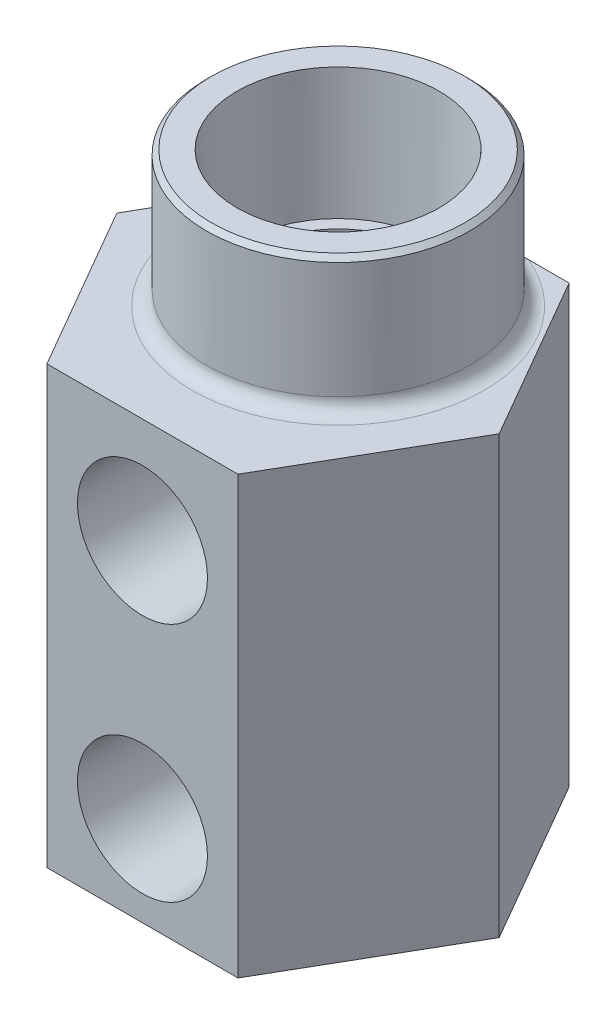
ISO-10303-21;
HEADER;
FILE_DESCRIPTION(('STEP AP214'),'2;1');
FILE_NAME('part.step','',(''),(''),'','','');
FILE_SCHEMA(('AUTOMOTIVE_DESIGN { 1 0 10303 214 1 1 1 1 }'));
ENDSEC;
DATA;
#1=APPLICATION_CONTEXT('core data for automotive mechanical design processes');
#2=APPLICATION_PROTOCOL_DEFINITION('international standard','automotive_design',2000,#1);
#3=PRODUCT_CONTEXT('',#1,'mechanical');
#4=PRODUCT('Part','Part','',(#3));
#5=PRODUCT_RELATED_PRODUCT_CATEGORY('part','',(#4));
#6=PRODUCT_DEFINITION_FORMATION('','',#4);
#7=PRODUCT_DEFINITION_CONTEXT('part definition',#1,'design');
#8=PRODUCT_DEFINITION('design','',#6,#7);
#9=PRODUCT_DEFINITION_SHAPE('','',#8);
#10=(LENGTH_UNIT() NAMED_UNIT(*) SI_UNIT(.MILLI.,.METRE.));
#11=(NAMED_UNIT(*) PLANE_ANGLE_UNIT() SI_UNIT($,.RADIAN.));
#12=(NAMED_UNIT(*) SI_UNIT($,.STERADIAN.) SOLID_ANGLE_UNIT());
#13=UNCERTAINTY_MEASURE_WITH_UNIT(LENGTH_MEASURE(1.E-05),#10,'distance_accuracy_value','');
#14=(GEOMETRIC_REPRESENTATION_CONTEXT(3) GLOBAL_UNCERTAINTY_ASSIGNED_CONTEXT((#13)) GLOBAL_UNIT_ASSIGNED_CONTEXT((#10,
#11,#12)) REPRESENTATION_CONTEXT('',''));
#15=CARTESIAN_POINT('',(0.,0.,0.));
#16=DIRECTION('',(0.,0.,1.));
#17=DIRECTION('',(1.,0.,0.));
#18=AXIS2_PLACEMENT_3D('',#15,#16,#17);
#19=CARTESIAN_POINT('',(0.,9.525,20.6375));
#20=DIRECTION('',(0.,0.,1.));
#21=DIRECTION('',(1.,0.,0.));
#22=AXIS2_PLACEMENT_3D('',#19,#20,#21);
#23=CYLINDRICAL_SURFACE('',#22,5.5626);
#24=CARTESIAN_POINT('',(0.,9.525,10.6045));
#25=DIRECTION('',(0.,0.,1.));
#26=DIRECTION('',(1.,0.,0.));
#27=AXIS2_PLACEMENT_3D('',#24,#25,#26);
#28=CIRCLE('',#27,5.5626);
#29=CARTESIAN_POINT('',(5.56260000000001,9.525,10.6045));
#30=VERTEX_POINT('',#29);
#31=EDGE_CURVE('E231',#30,#30,#28,.T.);
#32=ORIENTED_EDGE('',*,*,#31,.T.);
#33=EDGE_LOOP('',(#32));
#34=FACE_BOUND('',#33,.T.);
#35=CARTESIAN_POINT('',(0.,9.525,-7.9375));
#36=DIRECTION('',(0.,0.,1.));
#37=DIRECTION('',(1.,0.,0.));
#38=AXIS2_PLACEMENT_3D('',#35,#36,#37);
#39=CIRCLE('',#38,5.5626);
#40=CARTESIAN_POINT('',(5.56260000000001,9.525,-7.9375));
#41=VERTEX_POINT('',#40);
#42=EDGE_CURVE('E234',#41,#41,#39,.T.);
#43=ORIENTED_EDGE('',*,*,#42,.F.);
#44=EDGE_LOOP('',(#43));
#45=FACE_BOUND('',#44,.T.);
#46=DIRECTION('',(0.,0.,1.));
#47=VECTOR('',#46,1.);
#48=CARTESIAN_POINT('',(-5.3274645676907,11.1252,20.6375));
#49=LINE('',#48,#47);
#50=CARTESIAN_POINT('',(-5.3274645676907,11.1252,1.68637637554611));
#51=VERTEX_POINT('',#50);
#52=CARTESIAN_POINT('',(-5.3274645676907,11.1252,-1.68637637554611));
#53=VERTEX_POINT('',#52);
#54=EDGE_CURVE('E126',#51,#53,#49,.F.);
#55=ORIENTED_EDGE('',*,*,#54,.F.);
#56=CARTESIAN_POINT('',(-5.3274645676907,11.1252,1.68637637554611));
#57=CARTESIAN_POINT('',(-5.3025825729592,11.2080167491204,1.76498984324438));
#58=CARTESIAN_POINT('',(-5.27578300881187,11.2902514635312,1.84359698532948));
#59=CARTESIAN_POINT('',(-5.21828589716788,11.4536073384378,2.00055361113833));
#60=CARTESIAN_POINT('',(-5.18758808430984,11.5347284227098,2.07890307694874));
#61=CARTESIAN_POINT('',(-5.08947736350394,11.776680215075,2.3133751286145));
#62=CARTESIAN_POINT('',(-5.01610861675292,11.9358941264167,2.46872500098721));
#63=CARTESIAN_POINT('',(-4.8521116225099,12.2510609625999,2.77734103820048));
#64=CARTESIAN_POINT('',(-4.76131122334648,12.406962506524,2.93056853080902));
#65=CARTESIAN_POINT('',(-4.56234903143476,12.7125872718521,3.23160117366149));
#66=CARTESIAN_POINT('',(-4.45419776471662,12.8623141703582,3.37940954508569));
#67=CARTESIAN_POINT('',(-4.16234667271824,13.2257011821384,3.73862675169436));
#68=CARTESIAN_POINT('',(-3.96755763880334,13.4348414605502,3.94581142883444));
#69=CARTESIAN_POINT('',(-3.53593680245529,13.8290277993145,4.33673341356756));
#70=CARTESIAN_POINT('',(-3.29925609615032,14.0141564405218,4.52055103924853));
#71=CARTESIAN_POINT('',(-2.83867723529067,14.3148682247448,4.81931947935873));
#72=CARTESIAN_POINT('',(-2.6230783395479,14.4368337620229,4.94056723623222));
#73=CARTESIAN_POINT('',(-2.16674350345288,14.6544650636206,5.15698608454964));
#74=CARTESIAN_POINT('',(-1.92602960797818,14.7501536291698,5.25217978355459));
#75=CARTESIAN_POINT('',(-1.46291546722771,14.8963927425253,5.39768849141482));
#76=CARTESIAN_POINT('',(-1.24348438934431,14.9516475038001,5.45267936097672));
#77=CARTESIAN_POINT('',(-0.794622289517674,15.0352714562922,5.53591005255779));
#78=CARTESIAN_POINT('',(-0.565197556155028,15.0636573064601,5.56416645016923));
#79=CARTESIAN_POINT('',(-0.102212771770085,15.0915054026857,5.59188750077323));
#80=CARTESIAN_POINT('',(0.131356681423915,15.0908902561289,5.59127511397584));
#81=CARTESIAN_POINT('',(0.594695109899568,15.0605927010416,5.56111587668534));
#82=CARTESIAN_POINT('',(0.824463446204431,15.0309054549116,5.53156421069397));
#83=CARTESIAN_POINT('',(1.26512766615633,14.9462969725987,5.4473543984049));
#84=CARTESIAN_POINT('',(1.47640827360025,14.8923657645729,5.39368129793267));
#85=CARTESIAN_POINT('',(1.88518128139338,14.7628117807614,5.26477505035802));
#86=CARTESIAN_POINT('',(2.08266833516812,14.687180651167,5.18953360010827));
#87=CARTESIAN_POINT('',(2.53812034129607,14.4833630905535,4.986825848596));
#88=CARTESIAN_POINT('',(2.78820195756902,14.3462957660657,4.85054856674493));
#89=CARTESIAN_POINT('',(3.25384843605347,14.0452085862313,4.55139828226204));
#90=CARTESIAN_POINT('',(3.46933743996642,13.88113105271,4.38846836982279));
#91=CARTESIAN_POINT('',(3.94082085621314,13.4676326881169,3.97826861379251));
#92=CARTESIAN_POINT('',(4.1815354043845,13.2093334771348,3.72233546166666));
#93=CARTESIAN_POINT('',(4.49674488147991,12.8039020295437,3.32174671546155));
#94=CARTESIAN_POINT('',(4.59425456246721,12.6655957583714,3.18527306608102));
#95=CARTESIAN_POINT('',(4.77461936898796,12.3839272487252,2.90793440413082));
#96=CARTESIAN_POINT('',(4.85747895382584,12.240566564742,2.76707074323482));
#97=CARTESIAN_POINT('',(5.01529638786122,11.9376463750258,2.47043432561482));
#98=CARTESIAN_POINT('',(5.08904242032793,11.7777248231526,2.31438876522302));
#99=CARTESIAN_POINT('',(5.18748276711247,11.5350020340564,2.0791675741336));
#100=CARTESIAN_POINT('',(5.2182021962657,11.453835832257,2.00077378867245));
#101=CARTESIAN_POINT('',(5.2757430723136,11.2903741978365,1.84371430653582));
#102=CARTESIAN_POINT('',(5.3025641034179,11.2080786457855,1.7650485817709));
#103=CARTESIAN_POINT('',(5.32746456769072,11.1252,1.68637637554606));
#104=B_SPLINE_CURVE_WITH_KNOTS('',3,(#56,#57,#58,#59,#60,#61,#62,#63,#64,#65,#66,#67,#68,#69,
#70,#71,#72,#73,#74,#75,#76,#77,#78,#79,#80,#81,#82,#83,#84,#85,#86,#87,#88,#89,#90,#91,#92,#93,
#94,#95,#96,#97,#98,#99,#100,#101,#102,#103),.UNSPECIFIED.,.F.,.F.,(4,2,2,2,2,2,2,2,2,2,2,2,2,2,
2,2,2,2,2,2,2,2,2,4),(0.,0.350564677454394,0.701153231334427,1.40320046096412,2.11257524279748,
2.82152129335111,3.87697286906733,4.92869243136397,5.753032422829,6.57665483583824,
7.27225615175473,7.96742590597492,8.66445090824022,9.36159191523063,10.0325392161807,
10.7037451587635,11.6466820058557,12.591659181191,13.8922968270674,14.5440802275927,
15.195664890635,15.9008831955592,16.2516719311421,16.6024980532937),.UNSPECIFIED.);
#105=CARTESIAN_POINT('',(5.32746456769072,11.1252,1.68637637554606));
#106=VERTEX_POINT('',#105);
#107=EDGE_CURVE('E132',#51,#106,#104,.T.);
#108=ORIENTED_EDGE('',*,*,#107,.T.);
#109=DIRECTION('',(0.,0.,1.));
#110=VECTOR('',#109,1.);
#111=CARTESIAN_POINT('',(5.32746456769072,11.1252,20.6375));
#112=LINE('',#111,#110);
#113=CARTESIAN_POINT('',(5.32746456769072,11.1252,-1.68637637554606));
#114=VERTEX_POINT('',#113);
#115=EDGE_CURVE('E121',#114,#106,#112,.T.);
#116=ORIENTED_EDGE('',*,*,#115,.F.);
#117=CARTESIAN_POINT('',(5.32746456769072,11.1252,-1.68637637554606));
#118=CARTESIAN_POINT('',(5.30258257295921,11.2080167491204,-1.76498984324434));
#119=CARTESIAN_POINT('',(5.27578300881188,11.2902514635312,-1.84359698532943));
#120=CARTESIAN_POINT('',(5.2182858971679,11.4536073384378,-2.00055361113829));
#121=CARTESIAN_POINT('',(5.18758808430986,11.5347284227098,-2.0789030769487));
#122=CARTESIAN_POINT('',(5.08947736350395,11.776680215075,-2.31337512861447));
#123=CARTESIAN_POINT('',(5.01610861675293,11.9358941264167,-2.46872500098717));
#124=CARTESIAN_POINT('',(4.85211162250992,12.2510609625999,-2.77734103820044));
#125=CARTESIAN_POINT('',(4.7613112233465,12.406962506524,-2.93056853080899));
#126=CARTESIAN_POINT('',(4.56234903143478,12.7125872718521,-3.23160117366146));
#127=CARTESIAN_POINT('',(4.45419776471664,12.8623141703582,-3.37940954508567));
#128=CARTESIAN_POINT('',(4.16234667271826,13.2257011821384,-3.73862675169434));
#129=CARTESIAN_POINT('',(3.96755763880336,13.4348414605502,-3.94581142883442));
#130=CARTESIAN_POINT('',(3.53593680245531,13.8290277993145,-4.33673341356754));
#131=CARTESIAN_POINT('',(3.29925609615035,14.0141564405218,-4.52055103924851));
#132=CARTESIAN_POINT('',(2.8386772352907,14.3148682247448,-4.81931947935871));
#133=CARTESIAN_POINT('',(2.62307833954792,14.4368337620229,-4.9405672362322));
#134=CARTESIAN_POINT('',(2.16674350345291,14.6544650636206,-5.15698608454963));
#135=CARTESIAN_POINT('',(1.92602960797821,14.7501536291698,-5.25217978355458));
#136=CARTESIAN_POINT('',(1.46291546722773,14.8963927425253,-5.39768849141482));
#137=CARTESIAN_POINT('',(1.24348438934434,14.9516475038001,-5.45267936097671));
#138=CARTESIAN_POINT('',(0.794622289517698,15.0352714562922,-5.53591005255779));
#139=CARTESIAN_POINT('',(0.565197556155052,15.0636573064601,-5.56416645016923));
#140=CARTESIAN_POINT('',(0.102212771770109,15.0915054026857,-5.59188750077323));
#141=CARTESIAN_POINT('',(-0.131356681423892,15.0908902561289,-5.59127511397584));
#142=CARTESIAN_POINT('',(-0.594695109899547,15.0605927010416,-5.56111587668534));
#143=CARTESIAN_POINT('',(-0.82446344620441,15.0309054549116,-5.53156421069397));
#144=CARTESIAN_POINT('',(-1.26512766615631,14.9462969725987,-5.44735439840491));
#145=CARTESIAN_POINT('',(-1.47640827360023,14.8923657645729,-5.39368129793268));
#146=CARTESIAN_POINT('',(-1.88518128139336,14.7628117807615,-5.26477505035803));
#147=CARTESIAN_POINT('',(-2.0826683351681,14.687180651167,-5.18953360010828));
#148=CARTESIAN_POINT('',(-2.53812034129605,14.4833630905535,-4.98682584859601));
#149=CARTESIAN_POINT('',(-2.788201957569,14.3462957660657,-4.85054856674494));
#150=CARTESIAN_POINT('',(-3.25384843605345,14.0452085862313,-4.55139828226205));
#151=CARTESIAN_POINT('',(-3.4693374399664,13.88113105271,-4.38846836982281));
#152=CARTESIAN_POINT('',(-3.94082085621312,13.4676326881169,-3.97826861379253));
#153=CARTESIAN_POINT('',(-4.18153540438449,13.2093334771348,-3.72233546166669));
#154=CARTESIAN_POINT('',(-4.49674488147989,12.8039020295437,-3.32174671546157));
#155=CARTESIAN_POINT('',(-4.5942545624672,12.6655957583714,-3.18527306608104));
#156=CARTESIAN_POINT('',(-4.77461936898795,12.3839272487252,-2.90793440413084));
#157=CARTESIAN_POINT('',(-4.85747895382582,12.240566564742,-2.76707074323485));
#158=CARTESIAN_POINT('',(-5.0152963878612,11.9376463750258,-2.47043432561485));
#159=CARTESIAN_POINT('',(-5.08904242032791,11.7777248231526,-2.31438876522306));
#160=CARTESIAN_POINT('',(-5.18748276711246,11.5350020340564,-2.07916757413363));
#161=CARTESIAN_POINT('',(-5.21820219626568,11.453835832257,-2.00077378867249));
#162=CARTESIAN_POINT('',(-5.27574307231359,11.2903741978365,-1.84371430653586));
#163=CARTESIAN_POINT('',(-5.30256410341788,11.2080786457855,-1.76504858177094));
#164=CARTESIAN_POINT('',(-5.3274645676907,11.1252,-1.68637637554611));
#165=B_SPLINE_CURVE_WITH_KNOTS('',3,(#117,#118,#119,#120,#121,#122,#123,#124,#125,#126,#127,
#128,#129,#130,#131,#132,#133,#134,#135,#136,#137,#138,#139,#140,#141,#142,#143,#144,#145,#146,
#147,#148,#149,#150,#151,#152,#153,#154,#155,#156,#157,#158,#159,#160,#161,#162,#163,#164),
.UNSPECIFIED.,.F.,.F.,(4,2,2,2,2,2,2,2,2,2,2,2,2,2,2,2,2,2,2,2,2,2,2,4),(0.,0.350564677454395,
0.701153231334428,1.40320046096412,2.11257524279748,2.82152129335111,3.87697286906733,
4.92869243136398,5.75303242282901,6.57665483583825,7.27225615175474,7.96742590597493,
8.66445090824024,9.36159191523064,10.0325392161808,10.7037451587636,11.6466820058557,
12.591659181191,13.8922968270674,14.5440802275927,15.195664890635,15.9008831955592,
16.2516719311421,16.6024980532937),.UNSPECIFIED.);
#166=EDGE_CURVE('E134',#114,#53,#165,.T.);
#167=ORIENTED_EDGE('',*,*,#166,.T.);
#168=EDGE_LOOP('',(#55,#108,#116,#167));
#169=FACE_BOUND('',#168,.T.);
#170=ADVANCED_FACE('F37',(#34,#45,#169),#23,.F.);
#171=CARTESIAN_POINT('',(-20.1639581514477,46.0248,3.175));
#172=DIRECTION('',(0.866025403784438,0.,-0.5));
#173=DIRECTION('',(-0.5,0.,-0.866025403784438));
#174=AXIS2_PLACEMENT_3D('',#171,#172,#173);
#175=PLANE('',#174);
#176=DIRECTION('',(0.5,0.,0.866025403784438));
#177=VECTOR('',#176,1.);
#178=CARTESIAN_POINT('',(-20.1639581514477,0.,3.175));
#179=LINE('',#178,#177);
#180=CARTESIAN_POINT('',(-20.1639581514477,0.,3.175));
#181=VERTEX_POINT('',#180);
#182=CARTESIAN_POINT('',(-10.0819790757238,0.,20.6375));
#183=VERTEX_POINT('',#182);
#184=EDGE_CURVE('E262',#181,#183,#179,.T.);
#185=ORIENTED_EDGE('',*,*,#184,.T.);
#186=DIRECTION('',(0.,-1.,0.));
#187=VECTOR('',#186,1.);
#188=CARTESIAN_POINT('',(-10.0819790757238,46.0248,20.6375));
#189=LINE('',#188,#187);
#190=CARTESIAN_POINT('',(-10.0819790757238,46.0248,20.6375));
#191=VERTEX_POINT('',#190);
#192=EDGE_CURVE('E288',#191,#183,#189,.T.);
#193=ORIENTED_EDGE('',*,*,#192,.F.);
#194=DIRECTION('',(0.5,0.,0.866025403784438));
#195=VECTOR('',#194,1.);
#196=CARTESIAN_POINT('',(-20.1639581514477,46.0248,3.175));
#197=LINE('',#196,#195);
#198=CARTESIAN_POINT('',(-20.1639581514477,46.0248,3.175));
#199=VERTEX_POINT('',#198);
#200=EDGE_CURVE('E244',#199,#191,#197,.T.);
#201=ORIENTED_EDGE('',*,*,#200,.F.);
#202=DIRECTION('',(0.,-1.,0.));
#203=VECTOR('',#202,1.);
#204=CARTESIAN_POINT('',(-20.1639581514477,46.0248,3.175));
#205=LINE('',#204,#203);
#206=EDGE_CURVE('E261',#199,#181,#205,.T.);
#207=ORIENTED_EDGE('',*,*,#206,.T.);
#208=EDGE_LOOP('',(#185,#193,#201,#207));
#209=FACE_BOUND('',#208,.T.);
#210=ADVANCED_FACE('F221',(#209),#175,.F.);
#211=CARTESIAN_POINT('',(-10.0819790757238,46.0248,20.6375));
#212=DIRECTION('',(0.,0.,-1.));
#213=DIRECTION('',(-1.,0.,0.));
#214=AXIS2_PLACEMENT_3D('',#211,#212,#213);
#215=PLANE('',#214);
#216=CARTESIAN_POINT('',(0.,34.925,20.6375));
#217=DIRECTION('',(0.,0.,1.));
#218=DIRECTION('',(1.,0.,0.));
#219=AXIS2_PLACEMENT_3D('',#216,#217,#218);
#220=CIRCLE('',#219,6.858381);
#221=CARTESIAN_POINT('',(6.85838100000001,34.925,20.6375));
#222=VERTEX_POINT('',#221);
#223=EDGE_CURVE('E396',#222,#222,#220,.T.);
#224=ORIENTED_EDGE('',*,*,#223,.F.);
#225=EDGE_LOOP('',(#224));
#226=FACE_BOUND('',#225,.T.);
#227=CARTESIAN_POINT('',(0.,9.525,20.6375));
#228=DIRECTION('',(0.,0.,1.));
#229=DIRECTION('',(1.,0.,0.));
#230=AXIS2_PLACEMENT_3D('',#227,#228,#229);
#231=CIRCLE('',#230,6.858381);
#232=CARTESIAN_POINT('',(6.85838100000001,9.525,20.6375));
#233=VERTEX_POINT('',#232);
#234=EDGE_CURVE('E399',#233,#233,#231,.T.);
#235=ORIENTED_EDGE('',*,*,#234,.F.);
#236=EDGE_LOOP('',(#235));
#237=FACE_BOUND('',#236,.T.);
#238=DIRECTION('',(1.,0.,0.));
#239=VECTOR('',#238,1.);
#240=CARTESIAN_POINT('',(-10.0819790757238,0.,20.6375));
#241=LINE('',#240,#239);
#242=CARTESIAN_POINT('',(10.0819790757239,0.,20.6375));
#243=VERTEX_POINT('',#242);
#244=EDGE_CURVE('E265',#183,#243,#241,.T.);
#245=ORIENTED_EDGE('',*,*,#244,.T.);
#246=DIRECTION('',(0.,-1.,0.));
#247=VECTOR('',#246,1.);
#248=CARTESIAN_POINT('',(10.0819790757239,46.0248,20.6375));
#249=LINE('',#248,#247);
#250=CARTESIAN_POINT('',(10.0819790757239,46.0248,20.6375));
#251=VERTEX_POINT('',#250);
#252=EDGE_CURVE('E285',#251,#243,#249,.T.);
#253=ORIENTED_EDGE('',*,*,#252,.F.);
#254=DIRECTION('',(1.,0.,0.));
#255=VECTOR('',#254,1.);
#256=CARTESIAN_POINT('',(-10.0819790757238,46.0248,20.6375));
#257=LINE('',#256,#255);
#258=EDGE_CURVE('E247',#191,#251,#257,.T.);
#259=ORIENTED_EDGE('',*,*,#258,.F.);
#260=ORIENTED_EDGE('',*,*,#192,.T.);
#261=EDGE_LOOP('',(#245,#253,#259,#260));
#262=FACE_BOUND('',#261,.T.);
#263=ADVANCED_FACE('F226',(#226,#237,#262),#215,.F.);
#264=CARTESIAN_POINT('',(10.0819790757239,46.0248,20.6375));
#265=DIRECTION('',(-0.866025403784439,0.,-0.5));
#266=DIRECTION('',(-0.5,0.,0.866025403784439));
#267=AXIS2_PLACEMENT_3D('',#264,#265,#266);
#268=PLANE('',#267);
#269=DIRECTION('',(0.5,0.,-0.866025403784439));
#270=VECTOR('',#269,1.);
#271=CARTESIAN_POINT('',(10.0819790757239,0.,20.6375));
#272=LINE('',#271,#270);
#273=CARTESIAN_POINT('',(20.1639581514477,0.,3.175));
#274=VERTEX_POINT('',#273);
#275=EDGE_CURVE('E267',#243,#274,#272,.T.);
#276=ORIENTED_EDGE('',*,*,#275,.T.);
#277=DIRECTION('',(0.,-1.,0.));
#278=VECTOR('',#277,1.);
#279=CARTESIAN_POINT('',(20.1639581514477,46.0248,3.175));
#280=LINE('',#279,#278);
#281=CARTESIAN_POINT('',(20.1639581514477,46.0248,3.175));
#282=VERTEX_POINT('',#281);
#283=EDGE_CURVE('E282',#282,#274,#280,.T.);
#284=ORIENTED_EDGE('',*,*,#283,.F.);
#285=DIRECTION('',(0.5,0.,-0.866025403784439));
#286=VECTOR('',#285,1.);
#287=CARTESIAN_POINT('',(10.0819790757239,46.0248,20.6375));
#288=LINE('',#287,#286);
#289=EDGE_CURVE('E250',#251,#282,#288,.T.);
#290=ORIENTED_EDGE('',*,*,#289,.F.);
#291=ORIENTED_EDGE('',*,*,#252,.T.);
#292=EDGE_LOOP('',(#276,#284,#290,#291));
#293=FACE_BOUND('',#292,.T.);
#294=ADVANCED_FACE('F365',(#293),#268,.F.);
#295=CARTESIAN_POINT('',(20.1639581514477,46.0248,3.175));
#296=DIRECTION('',(-0.866025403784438,0.,0.5));
#297=DIRECTION('',(0.5,0.,0.866025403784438));
#298=AXIS2_PLACEMENT_3D('',#295,#296,#297);
#299=PLANE('',#298);
#300=DIRECTION('',(-0.5,0.,-0.866025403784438));
#301=VECTOR('',#300,1.);
#302=CARTESIAN_POINT('',(20.1639581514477,0.,3.175));
#303=LINE('',#302,#301);
#304=CARTESIAN_POINT('',(10.0819790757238,0.,-14.2875));
#305=VERTEX_POINT('',#304);
#306=EDGE_CURVE('E269',#274,#305,#303,.T.);
#307=ORIENTED_EDGE('',*,*,#306,.T.);
#308=DIRECTION('',(0.,-1.,0.));
#309=VECTOR('',#308,1.);
#310=CARTESIAN_POINT('',(10.0819790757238,46.0248,-14.2875));
#311=LINE('',#310,#309);
#312=CARTESIAN_POINT('',(10.0819790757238,46.0248,-14.2875));
#313=VERTEX_POINT('',#312);
#314=EDGE_CURVE('E279',#313,#305,#311,.T.);
#315=ORIENTED_EDGE('',*,*,#314,.F.);
#316=DIRECTION('',(-0.5,0.,-0.866025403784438));
#317=VECTOR('',#316,1.);
#318=CARTESIAN_POINT('',(20.1639581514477,46.0248,3.175));
#319=LINE('',#318,#317);
#320=EDGE_CURVE('E252',#282,#313,#319,.T.);
#321=ORIENTED_EDGE('',*,*,#320,.F.);
#322=ORIENTED_EDGE('',*,*,#283,.T.);
#323=EDGE_LOOP('',(#307,#315,#321,#322));
#324=FACE_BOUND('',#323,.T.);
#325=ADVANCED_FACE('F370',(#324),#299,.F.);
#326=CARTESIAN_POINT('',(10.0819790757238,46.0248,-14.2875));
#327=DIRECTION('',(0.,0.,1.));
#328=DIRECTION('',(1.,0.,0.));
#329=AXIS2_PLACEMENT_3D('',#326,#327,#328);
#330=PLANE('',#329);
#331=DIRECTION('',(-1.,0.,0.));
#332=VECTOR('',#331,1.);
#333=CARTESIAN_POINT('',(10.0819790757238,0.,-14.2875));
#334=LINE('',#333,#332);
#335=CARTESIAN_POINT('',(-10.0819790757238,0.,-14.2875));
#336=VERTEX_POINT('',#335);
#337=EDGE_CURVE('E271',#305,#336,#334,.T.);
#338=ORIENTED_EDGE('',*,*,#337,.T.);
#339=DIRECTION('',(0.,-1.,0.));
#340=VECTOR('',#339,1.);
#341=CARTESIAN_POINT('',(-10.0819790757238,46.0248,-14.2875));
#342=LINE('',#341,#340);
#343=CARTESIAN_POINT('',(-10.0819790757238,46.0248,-14.2875));
#344=VERTEX_POINT('',#343);
#345=EDGE_CURVE('E276',#344,#336,#342,.T.);
#346=ORIENTED_EDGE('',*,*,#345,.F.);
#347=DIRECTION('',(-1.,0.,0.));
#348=VECTOR('',#347,1.);
#349=CARTESIAN_POINT('',(10.0819790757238,46.0248,-14.2875));
#350=LINE('',#349,#348);
#351=CARTESIAN_POINT('',(-5.76059456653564,46.0248,-14.2875));
#352=VERTEX_POINT('',#351);
#353=EDGE_CURVE('E254',#352,#344,#350,.T.);
#354=ORIENTED_EDGE('',*,*,#353,.F.);
#355=CARTESIAN_POINT('',(5.76059456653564,46.0248,-14.2875));
#356=VERTEX_POINT('',#355);
#357=EDGE_CURVE('E259',#356,#352,#350,.T.);
#358=ORIENTED_EDGE('',*,*,#357,.F.);
#359=EDGE_CURVE('E255',#313,#356,#350,.T.);
#360=ORIENTED_EDGE('',*,*,#359,.F.);
#361=ORIENTED_EDGE('',*,*,#314,.T.);
#362=EDGE_LOOP('',(#338,#346,#354,#358,#360,#361));
#363=FACE_BOUND('',#362,.T.);
#364=ADVANCED_FACE('F351',(#363),#330,.F.);
#365=CARTESIAN_POINT('',(-10.0819790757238,46.0248,-14.2875));
#366=DIRECTION('',(0.866025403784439,0.,0.5));
#367=DIRECTION('',(0.5,0.,-0.866025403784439));
#368=AXIS2_PLACEMENT_3D('',#365,#366,#367);
#369=PLANE('',#368);
#370=DIRECTION('',(-0.5,0.,0.866025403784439));
#371=VECTOR('',#370,1.);
#372=CARTESIAN_POINT('',(-10.0819790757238,0.,-14.2875));
#373=LINE('',#372,#371);
#374=EDGE_CURVE('E248',#336,#181,#373,.T.);
#375=ORIENTED_EDGE('',*,*,#374,.T.);
#376=ORIENTED_EDGE('',*,*,#206,.F.);
#377=DIRECTION('',(-0.5,0.,0.866025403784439));
#378=VECTOR('',#377,1.);
#379=CARTESIAN_POINT('',(-10.0819790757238,46.0248,-14.2875));
#380=LINE('',#379,#378);
#381=EDGE_CURVE('E258',#344,#199,#380,.T.);
#382=ORIENTED_EDGE('',*,*,#381,.F.);
#383=ORIENTED_EDGE('',*,*,#345,.T.);
#384=EDGE_LOOP('',(#375,#376,#382,#383));
#385=FACE_BOUND('',#384,.T.);
#386=ADVANCED_FACE('F355',(#385),#369,.F.);
#387=CARTESIAN_POINT('',(0.,46.0248,0.));
#388=DIRECTION('',(0.,1.,0.));
#389=DIRECTION('',(0.,0.,1.));
#390=AXIS2_PLACEMENT_3D('',#387,#388,#389);
#391=PLANE('',#390);
#392=ORIENTED_EDGE('',*,*,#359,.T.);
#393=CARTESIAN_POINT('',(0.,46.0248,0.));
#394=DIRECTION('',(0.,1.,0.));
#395=DIRECTION('',(0.,0.,1.));
#396=AXIS2_PLACEMENT_3D('',#393,#394,#395);
#397=CIRCLE('',#396,15.4051);
#398=EDGE_CURVE('E302',#356,#352,#397,.F.);
#399=ORIENTED_EDGE('',*,*,#398,.T.);
#400=ORIENTED_EDGE('',*,*,#353,.T.);
#401=ORIENTED_EDGE('',*,*,#381,.T.);
#402=ORIENTED_EDGE('',*,*,#200,.T.);
#403=ORIENTED_EDGE('',*,*,#258,.T.);
#404=ORIENTED_EDGE('',*,*,#289,.T.);
#405=ORIENTED_EDGE('',*,*,#320,.T.);
#406=EDGE_LOOP('',(#392,#399,#400,#401,#402,#403,#404,#405));
#407=FACE_BOUND('',#406,.T.);
#408=ADVANCED_FACE('F348',(#407),#391,.T.);
#409=CARTESIAN_POINT('',(0.,0.,0.));
#410=DIRECTION('',(0.,1.,0.));
#411=DIRECTION('',(0.,0.,1.));
#412=AXIS2_PLACEMENT_3D('',#409,#410,#411);
#413=PLANE('',#412);
#414=ORIENTED_EDGE('',*,*,#184,.F.);
#415=ORIENTED_EDGE('',*,*,#374,.F.);
#416=ORIENTED_EDGE('',*,*,#337,.F.);
#417=ORIENTED_EDGE('',*,*,#306,.F.);
#418=ORIENTED_EDGE('',*,*,#275,.F.);
#419=ORIENTED_EDGE('',*,*,#244,.F.);
#420=EDGE_LOOP('',(#414,#415,#416,#417,#418,#419));
#421=FACE_BOUND('',#420,.T.);
#422=ADVANCED_FACE('F372',(#421),#413,.F.);
#423=CARTESIAN_POINT('',(0.,159.911679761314,0.));
#424=DIRECTION('',(0.,-1.,0.));
#425=DIRECTION('',(0.,0.,-1.));
#426=AXIS2_PLACEMENT_3D('',#423,#424,#425);
#427=CYLINDRICAL_SURFACE('',#426,13.8811);
#428=CARTESIAN_POINT('',(0.,59.817,0.));
#429=DIRECTION('',(0.,1.,0.));
#430=DIRECTION('',(0.,0.,1.));
#431=AXIS2_PLACEMENT_3D('',#428,#429,#430);
#432=CIRCLE('',#431,13.8811);
#433=CARTESIAN_POINT('',(0.,59.817,13.8811));
#434=VERTEX_POINT('',#433);
#435=EDGE_CURVE('E12',#434,#434,#432,.F.);
#436=ORIENTED_EDGE('',*,*,#435,.T.);
#437=EDGE_LOOP('',(#436));
#438=FACE_BOUND('',#437,.T.);
#439=CARTESIAN_POINT('',(0.,47.5488,0.));
#440=DIRECTION('',(0.,1.,0.));
#441=DIRECTION('',(0.,0.,1.));
#442=AXIS2_PLACEMENT_3D('',#439,#440,#441);
#443=CIRCLE('',#442,13.8811);
#444=CARTESIAN_POINT('',(-5.19070887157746,47.5488,-12.8740622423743));
#445=VERTEX_POINT('',#444);
#446=CARTESIAN_POINT('',(5.19070887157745,47.5488,-12.8740622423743));
#447=VERTEX_POINT('',#446);
#448=EDGE_CURVE('E291',#445,#447,#443,.T.);
#449=ORIENTED_EDGE('',*,*,#448,.T.);
#450=CARTESIAN_POINT('',(6.59870185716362,47.3602130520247,-12.2123736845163));
#451=CARTESIAN_POINT('',(6.41250934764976,46.550608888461,-12.312978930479));
#452=CARTESIAN_POINT('',(6.64823265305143,46.1161001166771,-12.9881712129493));
#453=CARTESIAN_POINT('',(6.8839559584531,45.6815913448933,-13.6633634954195));
#454=CARTESIAN_POINT('',(7.32317049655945,46.0248,-14.2875));
#455=CARTESIAN_POINT('',(6.53981292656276,47.3796155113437,-12.244195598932));
#456=CARTESIAN_POINT('',(6.36807132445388,46.5764729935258,-12.3358399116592));
#457=CARTESIAN_POINT('',(6.6001798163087,46.1382670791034,-12.9968028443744));
#458=CARTESIAN_POINT('',(6.83257583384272,45.6999330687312,-13.657708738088));
#459=CARTESIAN_POINT('',(7.25781617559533,46.0248,-14.2875));
#460=CARTESIAN_POINT('',(6.48031210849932,47.3970923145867,-12.2757929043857));
#461=CARTESIAN_POINT('',(6.32170730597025,46.6009893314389,-12.3594459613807));
#462=CARTESIAN_POINT('',(6.55040713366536,46.1596289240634,-13.0065219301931));
#463=CARTESIAN_POINT('',(6.77939039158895,45.7181561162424,-13.6535379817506));
#464=CARTESIAN_POINT('',(7.19178278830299,46.0248,-14.2875));
#465=CARTESIAN_POINT('',(6.36030474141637,47.4285946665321,-12.338396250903));
#466=CARTESIAN_POINT('',(6.22595306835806,46.6472062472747,-12.4075763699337));
#467=CARTESIAN_POINT('',(6.44797077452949,46.2006314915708,-13.027683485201));
#468=CARTESIAN_POINT('',(6.67026613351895,45.7539445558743,-13.6477345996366));
#469=CARTESIAN_POINT('',(7.05859986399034,46.0248,-14.2875));
#470=CARTESIAN_POINT('',(6.29979873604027,47.4426220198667,-12.3694025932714));
#471=CARTESIAN_POINT('',(6.17656652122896,46.6689305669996,-12.4321024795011));
#472=CARTESIAN_POINT('',(6.39530862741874,46.2202731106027,-13.0391250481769));
#473=CARTESIAN_POINT('',(6.6143273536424,45.771519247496,-13.6460859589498));
#474=CARTESIAN_POINT('',(6.99145093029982,46.0248,-14.2875));
#475=CARTESIAN_POINT('',(6.17808624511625,47.4676143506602,-12.4306404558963));
#476=CARTESIAN_POINT('',(6.07539883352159,46.7096096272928,-12.4816132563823));
#477=CARTESIAN_POINT('',(6.28772256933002,46.2577018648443,-13.0632604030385));
#478=CARTESIAN_POINT('',(6.50032139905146,45.8056985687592,-13.6448454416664));
#479=CARTESIAN_POINT('',(6.85637567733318,46.0248,-14.2875));
#480=CARTESIAN_POINT('',(6.11688184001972,47.4785867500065,-12.4608736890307));
#481=CARTESIAN_POINT('',(6.02362273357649,46.7285904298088,-12.5066008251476));
#482=CARTESIAN_POINT('',(6.232804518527,46.2754934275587,-13.0759510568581));
#483=CARTESIAN_POINT('',(6.44225561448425,45.8223148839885,-13.645237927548));
#484=CARTESIAN_POINT('',(6.78845166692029,46.0248,-14.2875));
#485=CARTESIAN_POINT('',(5.99375038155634,47.4978449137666,-12.520566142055));
#486=CARTESIAN_POINT('',(5.91794678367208,46.7639972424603,-12.5568005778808));
#487=CARTESIAN_POINT('',(6.1209538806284,46.3092886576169,-13.102277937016));
#488=CARTESIAN_POINT('',(6.32422912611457,45.8544992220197,-13.6476921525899));
#489=CARTESIAN_POINT('',(6.65180165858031,46.0248,-14.2875));
#490=CARTESIAN_POINT('',(5.93182322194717,47.5061302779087,-12.5500252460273));
#491=CARTESIAN_POINT('',(5.86404243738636,46.7804398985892,-12.5820185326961));
#492=CARTESIAN_POINT('',(6.06402099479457,46.3252920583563,-13.1159143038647));
#493=CARTESIAN_POINT('',(6.26426118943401,45.8700764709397,-13.6497464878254));
#494=CARTESIAN_POINT('',(6.58307554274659,46.0248,-14.2875));
#495=CARTESIAN_POINT('',(5.74657527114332,47.5272343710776,-12.6364640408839));
#496=CARTESIAN_POINT('',(5.70127113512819,46.8257163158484,-12.6568856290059));
#497=CARTESIAN_POINT('',(5.8920253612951,46.3703257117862,-13.157486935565));
#498=CARTESIAN_POINT('',(6.08379256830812,45.9146683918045,-13.6578440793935));
#499=CARTESIAN_POINT('',(6.37748929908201,46.0248,-14.2875));
#500=CARTESIAN_POINT('',(5.62235705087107,47.5365788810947,-12.6922254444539));
#501=CARTESIAN_POINT('',(5.58939377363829,46.8512509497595,-12.7067072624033));
#502=CARTESIAN_POINT('',(5.77448966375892,46.3968157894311,-13.1863835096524));
#503=CARTESIAN_POINT('',(5.96053336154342,45.9421951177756,-13.6658283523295));
#504=CARTESIAN_POINT('',(6.23963321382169,46.0248,-14.2875));
#505=CARTESIAN_POINT('',(5.37203556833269,47.5477812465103,-12.8001867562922));
#506=CARTESIAN_POINT('',(5.36037828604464,46.894222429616,-12.8049510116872));
#507=CARTESIAN_POINT('',(5.5344401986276,46.4435795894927,-13.2451759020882));
#508=CARTESIAN_POINT('',(5.70944623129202,45.9927536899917,-13.6851688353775));
#509=CARTESIAN_POINT('',(5.96182904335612,46.0248,-14.2875));
#510=CARTESIAN_POINT('',(5.24593084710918,47.54963297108,-12.8523837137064));
#511=CARTESIAN_POINT('',(5.24317600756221,46.9117350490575,-12.8534262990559));
#512=CARTESIAN_POINT('',(5.41192243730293,46.4638482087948,-13.2750725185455));
#513=CARTESIAN_POINT('',(5.58153956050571,46.0158393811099,-13.6965099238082));
#514=CARTESIAN_POINT('',(5.8218793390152,46.0248,-14.2875));
#515=CARTESIAN_POINT('',(4.97851932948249,47.5471777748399,-12.9584780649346));
#516=CARTESIAN_POINT('',(4.99193111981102,46.9414064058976,-12.9532124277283));
#517=CARTESIAN_POINT('',(5.1496100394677,46.500783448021,-13.3380036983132));
#518=CARTESIAN_POINT('',(5.3083509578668,46.0600102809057,-13.7225401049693));
#519=CARTESIAN_POINT('',(5.52510882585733,46.0248,-14.2875));
#520=CARTESIAN_POINT('',(4.83704786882,47.5421807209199,-13.0119453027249));
#521=CARTESIAN_POINT('',(4.85725221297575,46.9528658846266,-13.0043696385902));
#522=CARTESIAN_POINT('',(5.00938334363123,46.5168204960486,-13.3710267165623));
#523=CARTESIAN_POINT('',(5.16247586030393,46.080684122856,-13.7374642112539));
#524=CARTESIAN_POINT('',(5.36810527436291,46.0248,-14.2875));
#525=CARTESIAN_POINT('',(4.55265693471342,47.5264165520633,-13.114156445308));
#526=CARTESIAN_POINT('',(4.58409123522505,46.968867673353,-13.1031710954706));
#527=CARTESIAN_POINT('',(4.72532625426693,46.5431364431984,-13.4359322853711));
#528=CARTESIAN_POINT('',(4.86751667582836,46.117318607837,-13.7684750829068));
#529=CARTESIAN_POINT('',(5.05249118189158,46.0248,-14.2875));
#530=CARTESIAN_POINT('',(4.40973713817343,47.5156481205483,-13.1628992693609));
#531=CARTESIAN_POINT('',(4.44551745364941,46.9734616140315,-13.1508801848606));
#532=CARTESIAN_POINT('',(4.5814950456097,46.5534140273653,-13.4678145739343));
#533=CARTESIAN_POINT('',(4.7183277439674,46.1333253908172,-13.7845675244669));
#534=CARTESIAN_POINT('',(4.89388028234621,46.0248,-14.2875));
#535=CARTESIAN_POINT('',(3.97904073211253,47.4768028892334,-13.3020003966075));
#536=CARTESIAN_POINT('',(4.02642231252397,46.978911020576,-13.2876159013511));
#537=CARTESIAN_POINT('',(4.14561235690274,46.5770689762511,-13.5606565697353));
#538=CARTESIAN_POINT('',(4.26820266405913,46.1750317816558,-13.8329716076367));
#539=CARTESIAN_POINT('',(4.41589790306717,46.0248,-14.2875));
#540=CARTESIAN_POINT('',(3.68941176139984,47.4421886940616,-13.385197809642));
#541=CARTESIAN_POINT('',(3.73960689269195,46.9716539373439,-13.3713664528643));
#542=CARTESIAN_POINT('',(3.84925554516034,46.5832580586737,-13.6187905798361));
#543=CARTESIAN_POINT('',(3.9615486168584,46.1948524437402,-13.8657529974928));
#544=CARTESIAN_POINT('',(4.09447069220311,46.0248,-14.2875));
#545=CARTESIAN_POINT('',(3.10496802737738,47.3650947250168,-13.5327544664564));
#546=CARTESIAN_POINT('',(3.15689977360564,46.9444627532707,-13.5207976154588));
#547=CARTESIAN_POINT('',(3.24733794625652,46.5835851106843,-13.7241844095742));
#548=CARTESIAN_POINT('',(3.3404184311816,46.2227142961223,-13.9271072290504));
#549=CARTESIAN_POINT('',(3.44586113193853,46.0248,-14.2875));
#550=CARTESIAN_POINT('',(2.81013583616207,47.3225803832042,-13.5970275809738));
#551=CARTESIAN_POINT('',(2.86026882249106,46.924546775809,-13.5867553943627));
#552=CARTESIAN_POINT('',(2.94174185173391,46.5776689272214,-13.7713943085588));
#553=CARTESIAN_POINT('',(3.0251463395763,46.230843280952,-13.9557800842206));
#554=CARTESIAN_POINT('',(3.11865944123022,46.0248,-14.2875));
#555=CARTESIAN_POINT('',(2.21664153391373,47.2392771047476,-13.7062919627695));
#556=CARTESIAN_POINT('',(2.26090583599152,46.8810804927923,-13.6991783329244));
#557=CARTESIAN_POINT('',(2.32416678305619,46.5604845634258,-13.852689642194));
#558=CARTESIAN_POINT('',(2.38934093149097,46.2399434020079,-14.0059479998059));
#559=CARTESIAN_POINT('',(2.46000565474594,46.0248,-14.2875));
#560=CARTESIAN_POINT('',(1.91797925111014,47.1984882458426,-13.7512823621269));
#561=CARTESIAN_POINT('',(1.95750953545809,46.8575016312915,-13.7458949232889));
#562=CARTESIAN_POINT('',(2.01218752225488,46.5492161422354,-13.8867744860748));
#563=CARTESIAN_POINT('',(2.06809551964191,46.2409691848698,-14.0275459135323));
#564=CARTESIAN_POINT('',(2.12855336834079,46.0248,-14.2875));
#565=CARTESIAN_POINT('',(1.44059914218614,47.1432263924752,-13.8072940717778));
#566=CARTESIAN_POINT('',(1.47135809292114,46.8243666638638,-13.8041252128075));
#567=CARTESIAN_POINT('',(1.51242626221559,46.5324124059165,-13.9294890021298));
#568=CARTESIAN_POINT('',(1.55391967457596,46.2404741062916,-14.0548182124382));
#569=CARTESIAN_POINT('',(1.59876190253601,46.0248,-14.2875));
#570=CARTESIAN_POINT('',(1.26298885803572,47.1248250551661,-13.824677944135));
#571=CARTESIAN_POINT('',(1.29027058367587,46.8130248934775,-13.8222349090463));
#572=CARTESIAN_POINT('',(1.32625098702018,46.5264229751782,-13.9428240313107));
#573=CARTESIAN_POINT('',(1.36251742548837,46.2398291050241,-14.0633972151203));
#574=CARTESIAN_POINT('',(1.40165186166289,46.0248,-14.2875));
#575=CARTESIAN_POINT('',(0.906808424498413,47.0942488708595,-13.8526002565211));
#576=CARTESIAN_POINT('',(0.926870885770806,46.7939642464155,-13.8513312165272));
#577=CARTESIAN_POINT('',(0.952583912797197,46.5161799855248,-13.9642996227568));
#578=CARTESIAN_POINT('',(0.978582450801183,46.2384033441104,-14.0772511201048));
#579=CARTESIAN_POINT('',(1.00636653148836,46.0248,-14.2875));
#580=CARTESIAN_POINT('',(0.728238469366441,47.0820728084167,-13.8631400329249));
#581=CARTESIAN_POINT('',(0.744423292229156,46.7862319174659,-13.8623411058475));
#582=CARTESIAN_POINT('',(0.765092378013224,46.5119260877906,-13.9724411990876));
#583=CARTESIAN_POINT('',(0.785906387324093,46.2376222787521,-14.0825369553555));
#584=CARTESIAN_POINT('',(0.808191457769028,46.0248,-14.2875));
#585=CARTESIAN_POINT('',(0.370669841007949,47.0655132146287,-13.877302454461));
#586=CARTESIAN_POINT('',(0.379038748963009,46.7756845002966,-13.8771285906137));
#587=CARTESIAN_POINT('',(0.389506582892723,46.5060907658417,-13.9833902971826));
#588=CARTESIAN_POINT('',(0.40011900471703,46.2364995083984,-14.0896479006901));
#589=CARTESIAN_POINT('',(0.411365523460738,46.0248,-14.2875));
#590=CARTESIAN_POINT('',(0.191671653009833,47.061123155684,-13.8809308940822));
#591=CARTESIAN_POINT('',(0.195965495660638,46.7728575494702,-13.8809233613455));
#592=CARTESIAN_POINT('',(0.201412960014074,46.5045071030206,-13.9862022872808));
#593=CARTESIAN_POINT('',(0.206863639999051,46.2361566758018,-14.091481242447));
#594=CARTESIAN_POINT('',(0.212715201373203,46.0248,-14.2875));
#595=CARTESIAN_POINT('',(-0.166337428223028,47.0607322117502,-13.8812575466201));
#596=CARTESIAN_POINT('',(-0.170060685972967,46.7726068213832,-13.8812645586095));
#597=CARTESIAN_POINT('',(-0.174791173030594,46.504367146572,-13.9864551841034));
#598=CARTESIAN_POINT('',(-0.179518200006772,46.2361274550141,-14.0916457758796));
#599=CARTESIAN_POINT('',(-0.184599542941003,46.0248,-14.2875));
#600=CARTESIAN_POINT('',(-0.345348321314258,47.0647312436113,-13.877955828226));
#601=CARTESIAN_POINT('',(-0.353151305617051,46.7751828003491,-13.8778113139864));
#602=CARTESIAN_POINT('',(-0.362901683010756,46.5058108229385,-13.9838961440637));
#603=CARTESIAN_POINT('',(-0.372790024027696,46.2364410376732,-14.089977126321));
#604=CARTESIAN_POINT('',(-0.383263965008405,46.0248,-14.2875));
#605=CARTESIAN_POINT('',(-0.703237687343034,47.0805743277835,-13.8644344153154));
#606=CARTESIAN_POINT('',(-0.718881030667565,46.7852801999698,-13.8636926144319));
#607=CARTESIAN_POINT('',(-0.738838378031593,46.5114017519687,-13.9734412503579));
#608=CARTESIAN_POINT('',(-0.758934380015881,46.2375252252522,-14.0831860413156));
#609=CARTESIAN_POINT('',(-0.780445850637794,46.0248,-14.2875));
#610=CARTESIAN_POINT('',(-0.882114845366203,47.0924369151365,-13.8541983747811));
#611=CARTESIAN_POINT('',(-0.901655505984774,46.7928207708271,-13.8529994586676));
#612=CARTESIAN_POINT('',(-0.926662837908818,46.5155553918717,-13.9655327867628));
#613=CARTESIAN_POINT('',(-0.951950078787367,46.2382976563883,-14.0780503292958));
#614=CARTESIAN_POINT('',(-0.97896185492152,46.0248,-14.2875));
#615=CARTESIAN_POINT('',(-1.23892993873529,47.12249042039,-13.8268586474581));
#616=CARTESIAN_POINT('',(-1.26573754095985,46.8115810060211,-13.8245057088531));
#617=CARTESIAN_POINT('',(-1.30102409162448,46.5256560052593,-13.944497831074));
#618=CARTESIAN_POINT('',(-1.33659115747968,46.2397384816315,-14.064474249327));
#619=CARTESIAN_POINT('',(-1.37495152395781,46.0248,-14.2875));
#620=CARTESIAN_POINT('',(-1.4168676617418,47.1406827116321,-13.809753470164));
#621=CARTESIAN_POINT('',(-1.44718114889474,46.8228141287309,-13.8066820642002));
#622=CARTESIAN_POINT('',(-1.48756059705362,46.5316033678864,-13.9313702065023));
#623=CARTESIAN_POINT('',(-1.52836054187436,46.240407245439,-14.056023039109));
#624=CARTESIAN_POINT('',(-1.57242495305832,46.0248,-14.2875));
#625=CARTESIAN_POINT('',(-1.77183012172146,47.1813906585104,-13.7687155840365));
#626=CARTESIAN_POINT('',(-1.80842630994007,46.8472561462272,-13.7640497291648));
#627=CARTESIAN_POINT('',(-1.85920554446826,46.5440484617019,-13.9000637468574));
#628=CARTESIAN_POINT('',(-1.91040818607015,46.2408543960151,-14.0360419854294));
#629=CARTESIAN_POINT('',(-1.96635858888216,46.0248,-14.2875));
#630=CARTESIAN_POINT('',(-1.94885294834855,47.2039131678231,-13.7447720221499));
#631=CARTESIAN_POINT('',(-1.98835999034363,46.8604820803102,-13.7391975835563));
#632=CARTESIAN_POINT('',(-2.04431123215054,46.5505470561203,-13.8818768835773));
#633=CARTESIAN_POINT('',(-2.10082713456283,46.2406294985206,-14.0244925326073));
#634=CARTESIAN_POINT('',(-2.16281667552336,46.0248,-14.2875));
#635=CARTESIAN_POINT('',(-2.30158843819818,47.251111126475,-13.6901235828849));
#636=CARTESIAN_POINT('',(-2.34593960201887,46.8870299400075,-13.6827043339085));
#637=CARTESIAN_POINT('',(-2.41247897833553,46.5627025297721,-13.8407152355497));
#638=CARTESIAN_POINT('',(-2.47958393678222,46.2383949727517,-13.9986634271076));
#639=CARTESIAN_POINT('',(-2.55427884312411,46.0248,-14.2875));
#640=CARTESIAN_POINT('',(-2.47730115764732,47.2757864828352,-13.6594189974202));
#641=CARTESIAN_POINT('',(-2.52372191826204,46.9003627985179,-13.651019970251));
#642=CARTESIAN_POINT('',(-2.59554112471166,46.5683594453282,-13.8177406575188));
#643=CARTESIAN_POINT('',(-2.66806729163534,46.2363790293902,-13.984365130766));
#644=CARTESIAN_POINT('',(-2.74928298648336,46.0248,-14.2875));
#645=CARTESIAN_POINT('',(-2.95858624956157,47.3437384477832,-13.5657298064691));
#646=CARTESIAN_POINT('',(-3.00970787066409,46.9346343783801,-13.5546572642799));
#647=CARTESIAN_POINT('',(-3.0957209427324,46.5808328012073,-13.748376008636));
#648=CARTESIAN_POINT('',(-3.18391908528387,46.2270763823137,-13.9417885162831));
#649=CARTESIAN_POINT('',(-3.2834081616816,46.0248,-14.2875));
#650=CARTESIAN_POINT('',(-3.26284689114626,47.3871042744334,-13.4957929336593));
#651=CARTESIAN_POINT('',(-3.31519858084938,46.9537160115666,-13.4830498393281));
#652=CARTESIAN_POINT('',(-3.41054647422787,46.5853441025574,-13.6973366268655));
#653=CARTESIAN_POINT('',(-3.50887768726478,46.2169377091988,-13.9110745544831));
#654=CARTESIAN_POINT('',(-3.62107344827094,46.0248,-14.2875));
#655=CARTESIAN_POINT('',(-3.7155182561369,47.4443877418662,-13.3755059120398));
#656=CARTESIAN_POINT('',(-3.76394689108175,46.9708017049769,-13.3620502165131));
#657=CARTESIAN_POINT('',(-3.87549574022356,46.581287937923,-13.6123385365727));
#658=CARTESIAN_POINT('',(-3.98779056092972,46.1917719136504,-13.8624922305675));
#659=CARTESIAN_POINT('',(-4.12344340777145,46.0248,-14.2875));
#660=CARTESIAN_POINT('',(-3.86562766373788,47.4621728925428,-13.3329012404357));
#661=CARTESIAN_POINT('',(-3.91247819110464,46.9745764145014,-13.3192835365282));
#662=CARTESIAN_POINT('',(-4.0291010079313,46.5781413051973,-13.5826361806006));
#663=CARTESIAN_POINT('',(-4.14657534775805,46.1816771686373,-13.8458165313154));
#664=CARTESIAN_POINT('',(-4.29003326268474,46.0248,-14.2875));
#665=CARTESIAN_POINT('',(-4.16466877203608,47.4938525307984,-13.2425402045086));
#666=CARTESIAN_POINT('',(-4.20650165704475,46.9770112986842,-13.2293574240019));
#667=CARTESIAN_POINT('',(-4.33360062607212,46.5672663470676,-13.5208870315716));
#668=CARTESIAN_POINT('',(-4.46155675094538,46.1574893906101,-13.812242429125));
#669=CARTESIAN_POINT('',(-4.62190596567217,46.0248,-14.2875));
#670=CARTESIAN_POINT('',(-4.31360028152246,47.507746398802,-13.1947830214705));
#671=CARTESIAN_POINT('',(-4.3520922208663,46.9756427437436,-13.1821370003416));
#672=CARTESIAN_POINT('',(-4.48449454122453,46.5595372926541,-13.4888398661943));
#673=CARTESIAN_POINT('',(-4.61786265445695,46.1433636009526,-13.7953294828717));
#674=CARTESIAN_POINT('',(-4.78718860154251,46.0248,-14.2875));
#675=CARTESIAN_POINT('',(-4.60962852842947,47.5301453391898,-13.0942971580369));
#676=CARTESIAN_POINT('',(-4.63907241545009,46.9663927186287,-13.0838811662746));
#677=CARTESIAN_POINT('',(-4.78244867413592,46.5384883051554,-13.4231524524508));
#678=CARTESIAN_POINT('',(-4.92679085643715,46.1105156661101,-13.7622111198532));
#679=CARTESIAN_POINT('',(-5.11571766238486,46.0248,-14.2875));
#680=CARTESIAN_POINT('',(-4.75672939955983,47.538666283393,-13.0415836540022));
#681=CARTESIAN_POINT('',(-4.7805759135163,46.9584841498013,-13.0327882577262));
#682=CARTESIAN_POINT('',(-4.92951894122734,46.525185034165,-13.3895172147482));
#683=CARTESIAN_POINT('',(-5.07953868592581,46.0917625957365,-13.7459933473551));
#684=CARTESIAN_POINT('',(-5.27896867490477,46.0248,-14.2875));
#685=CARTESIAN_POINT('',(-5.04917949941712,47.5487221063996,-12.9311693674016));
#686=CARTESIAN_POINT('',(-5.05875287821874,46.9346401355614,-12.9273456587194));
#687=CARTESIAN_POINT('',(-5.21926788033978,46.4919085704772,-13.3215161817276));
#688=CARTESIAN_POINT('',(-5.38086669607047,46.0490521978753,-13.7154324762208));
#689=CARTESIAN_POINT('',(-5.60352674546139,46.0248,-14.2875));
#690=CARTESIAN_POINT('',(-5.19452954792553,47.5502603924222,-12.8734710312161));
#691=CARTESIAN_POINT('',(-5.19552832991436,46.9186367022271,-12.8729216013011));
#692=CARTESIAN_POINT('',(-5.3619486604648,46.471938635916,-13.2871507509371));
#693=CARTESIAN_POINT('',(-5.5295648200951,46.0250374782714,-13.7010876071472));
#694=CARTESIAN_POINT('',(-5.76483471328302,46.0248,-14.2875));
#695=CARTESIAN_POINT('',(-5.48405753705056,47.5443399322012,-12.7528343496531));
#696=CARTESIAN_POINT('',(-5.46373501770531,46.8767316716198,-12.7614372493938));
#697=CARTESIAN_POINT('',(-5.64251533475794,46.4240425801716,-13.2188042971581));
#698=CARTESIAN_POINT('',(-5.82251473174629,45.9711443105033,-13.6758753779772));
#699=CARTESIAN_POINT('',(-6.08614985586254,46.0248,-14.2875));
#700=CARTESIAN_POINT('',(-5.62822172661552,47.5368226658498,-12.6898643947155));
#701=CARTESIAN_POINT('',(-5.59521349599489,46.8506582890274,-12.7042829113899));
#702=CARTESIAN_POINT('',(-5.78036405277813,46.3960656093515,-13.1848272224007));
#703=CARTESIAN_POINT('',(-5.96683942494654,45.9411501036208,-13.6650491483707));
#704=CARTESIAN_POINT('',(-6.24614176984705,46.0248,-14.2875));
#705=CARTESIAN_POINT('',(-5.84237284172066,47.5167537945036,-12.5919735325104));
#706=CARTESIAN_POINT('',(-5.78552603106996,46.8027981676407,-12.6182971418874));
#707=CARTESIAN_POINT('',(-5.9811637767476,46.3473813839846,-13.1359104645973));
#708=CARTESIAN_POINT('',(-6.17713663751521,45.8918841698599,-13.6534419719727));
#709=CARTESIAN_POINT('',(-6.48380444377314,46.0248,-14.2875));
#710=CARTESIAN_POINT('',(-5.91347054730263,47.5085873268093,-12.5587390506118));
#711=CARTESIAN_POINT('',(-5.84811698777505,46.7852776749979,-12.5894449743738));
#712=CARTESIAN_POINT('',(-6.04715829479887,46.3300148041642,-13.1199328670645));
#713=CARTESIAN_POINT('',(-6.24654476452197,45.8746523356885,-13.6503393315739));
#714=CARTESIAN_POINT('',(-6.5627079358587,46.0248,-14.2875));
#715=CARTESIAN_POINT('',(-6.05480981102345,47.4888844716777,-12.4912113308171));
#716=CARTESIAN_POINT('',(-5.97070083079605,46.7470189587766,-12.5319179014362));
#717=CARTESIAN_POINT('',(-6.17670000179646,46.2929606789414,-13.0890682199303));
#718=CARTESIAN_POINT('',(-6.3830482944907,45.8388034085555,-13.646134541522));
#719=CARTESIAN_POINT('',(-6.71956477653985,46.0248,-14.2875));
#720=CARTESIAN_POINT('',(-6.12505102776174,47.4773467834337,-12.456917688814));
#721=CARTESIAN_POINT('',(-6.03069973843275,46.7262555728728,-12.5032341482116));
#722=CARTESIAN_POINT('',(-6.24024623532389,46.2732722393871,-13.0741815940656));
#723=CARTESIAN_POINT('',(-6.45015375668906,45.8201721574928,-13.6450432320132));
#724=CARTESIAN_POINT('',(-6.79751774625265,46.0248,-14.2875));
#725=CARTESIAN_POINT('',(-6.19478042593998,47.4639102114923,-12.4221428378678));
#726=CARTESIAN_POINT('',(-6.08899024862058,46.703823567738,-12.4748991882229));
#727=CARTESIAN_POINT('',(-6.3023383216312,46.2523879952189,-13.0600444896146));
#728=CARTESIAN_POINT('',(-6.51568639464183,45.8009524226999,-13.6451897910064));
#729=CARTESIAN_POINT('',(-6.87490270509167,46.0248,-14.2875));
#730=(BOUNDED_SURFACE() B_SPLINE_SURFACE(3,2,((#450,#451,#452,#453,#454),(#455,#456,#457,#458,
#459),(#460,#461,#462,#463,#464),(#465,#466,#467,#468,#469),(#470,#471,#472,#473,#474),(#475,
#476,#477,#478,#479),(#480,#481,#482,#483,#484),(#485,#486,#487,#488,#489),(#490,#491,#492,#493,
#494),(#495,#496,#497,#498,#499),(#500,#501,#502,#503,#504),(#505,#506,#507,#508,#509),(#510,
#511,#512,#513,#514),(#515,#516,#517,#518,#519),(#520,#521,#522,#523,#524),(#525,#526,#527,#528,
#529),(#530,#531,#532,#533,#534),(#535,#536,#537,#538,#539),(#540,#541,#542,#543,#544),(#545,
#546,#547,#548,#549),(#550,#551,#552,#553,#554),(#555,#556,#557,#558,#559),(#560,#561,#562,#563,
#564),(#565,#566,#567,#568,#569),(#570,#571,#572,#573,#574),(#575,#576,#577,#578,#579),(#580,
#581,#582,#583,#584),(#585,#586,#587,#588,#589),(#590,#591,#592,#593,#594),(#595,#596,#597,#598,
#599),(#600,#601,#602,#603,#604),(#605,#606,#607,#608,#609),(#610,#611,#612,#613,#614),(#615,
#616,#617,#618,#619),(#620,#621,#622,#623,#624),(#625,#626,#627,#628,#629),(#630,#631,#632,#633,
#634),(#635,#636,#637,#638,#639),(#640,#641,#642,#643,#644),(#645,#646,#647,#648,#649),(#650,
#651,#652,#653,#654),(#655,#656,#657,#658,#659),(#660,#661,#662,#663,#664),(#665,#666,#667,#668,
#669),(#670,#671,#672,#673,#674),(#675,#676,#677,#678,#679),(#680,#681,#682,#683,#684),(#685,
#686,#687,#688,#689),(#690,#691,#692,#693,#694),(#695,#696,#697,#698,#699),(#700,#701,#702,#703,
#704),(#705,#706,#707,#708,#709),(#710,#711,#712,#713,#714),(#715,#716,#717,#718,#719),(#720,
#721,#722,#723,#724),(#725,#726,#727,#728,#729)),.UNSPECIFIED.,.F.,.F.,
.F.) B_SPLINE_SURFACE_WITH_KNOTS((4,2,2,2,2,2,2,2,2,2,2,2,2,2,2,2,2,2,2,2,2,2,2,2,2,2,2,4),(3,2,
3),(0.,0.230272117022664,0.460423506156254,0.690010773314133,0.91963222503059,1.37348931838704,
1.82771769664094,2.33123824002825,2.83487369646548,3.84244684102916,4.85453722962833,
5.86667316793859,6.46318928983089,7.0595889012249,7.65548826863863,8.25138172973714,
8.84868477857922,9.44611750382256,10.0445037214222,10.6428641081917,11.6894036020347,
12.2115397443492,12.7337589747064,13.2544282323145,13.7748433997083,14.2986397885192,
14.5610118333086,14.8234852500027),(0.,0.5,1.),
.UNSPECIFIED.) GEOMETRIC_REPRESENTATION_ITEM() RATIONAL_B_SPLINE_SURFACE(((1.,0.87655372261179,
1.,0.87655372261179,1.),(1.,0.879115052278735,1.,0.879115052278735,1.),(1.,0.881604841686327,1.,
0.881604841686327,1.),(1.,0.886446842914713,1.,0.886446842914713,1.),(1.,0.888799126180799,1.,
0.888799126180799,1.),(1.,0.893368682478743,1.,0.893368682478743,1.),(1.,0.895586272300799,1.,
0.895586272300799,1.),(1.,0.899900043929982,1.,0.899900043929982,1.),(1.,0.901996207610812,1.,
0.901996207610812,1.),(1.,0.908065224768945,1.,0.908065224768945,1.),(1.,0.911871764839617,1.,
0.911871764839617,1.),(1.,0.919086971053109,1.,0.919086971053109,1.),(1.,0.922495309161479,1.,
0.922495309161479,1.),(1.,0.929301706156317,1.,0.929301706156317,1.),(1.,0.932658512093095,1.,
0.932658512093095,1.),(1.,0.938973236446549,1.,0.938973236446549,1.),(1.,0.941931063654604,1.,
0.941931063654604,1.),(1.,0.950262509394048,1.,0.950262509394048,1.),(1.,0.955091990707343,1.,
0.955091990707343,1.),(1.,0.963517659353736,1.,0.963517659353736,1.),(1.,0.967108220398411,1.,
0.967108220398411,1.),(1.,0.973147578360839,1.,0.973147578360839,1.),(1.,0.975596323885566,1.,
0.975596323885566,1.),(1.,0.978627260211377,1.,0.978627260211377,1.),(1.,0.979563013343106,1.,
0.979563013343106,1.),(1.,0.981062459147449,1.,0.981062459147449,1.),(1.,0.981626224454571,1.,
0.981626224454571,1.),(1.,0.98238317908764,1.,0.98238317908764,1.),(1.,0.982576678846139,1.,
0.982576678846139,1.),(1.,0.982594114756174,1.,0.982594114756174,1.),(1.,0.982418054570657,1.,
0.982418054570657,1.),(1.,0.981695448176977,1.,0.981695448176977,1.),(1.,0.981148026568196,1.,
0.981148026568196,1.),(1.,0.979680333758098,1.,0.979680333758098,1.),(1.,0.978759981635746,1.,
0.978759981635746,1.),(1.,0.976540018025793,1.,0.976540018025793,1.),(1.,0.975239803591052,1.,
0.975239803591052,1.),(1.,0.972250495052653,1.,0.972250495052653,1.),(1.,0.970561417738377,1.,
0.970561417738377,1.),(1.,0.965361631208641,1.,0.965361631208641,1.),(1.,0.961434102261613,1.,
0.961434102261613,1.),(1.,0.954510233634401,1.,0.954510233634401,1.),(1.,0.95203343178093,1.,
0.95203343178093,1.),(1.,0.946706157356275,1.,0.946706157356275,1.),(1.,0.943855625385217,1.,
0.943855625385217,1.),(1.,0.937756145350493,1.,0.937756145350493,1.),(1.,0.934508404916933,1.,
0.934508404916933,1.),(1.,0.927566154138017,1.,0.927566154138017,1.),(1.,0.923871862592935,1.,
0.923871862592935,1.),(1.,0.91595431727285,1.,0.91595431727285,1.),(1.,0.911727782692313,1.,
0.911727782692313,1.),(1.,0.904950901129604,1.,0.904950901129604,1.),(1.,0.902616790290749,1.,
0.902616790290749,1.),(1.,0.897792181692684,1.,0.897792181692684,1.),(1.,0.895301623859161,1.,
0.895301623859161,1.),(1.,0.892727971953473,1.,0.892727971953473,1.))) REPRESENTATION_ITEM('') SURFACE());
#731=CARTESIAN_POINT('',(6.59870185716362,47.3602130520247,-12.2123736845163));
#732=CARTESIAN_POINT('',(6.53981292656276,47.3796155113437,-12.244195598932));
#733=CARTESIAN_POINT('',(6.48031210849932,47.3970923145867,-12.2757929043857));
#734=CARTESIAN_POINT('',(6.36030474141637,47.4285946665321,-12.338396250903));
#735=CARTESIAN_POINT('',(6.29979873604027,47.4426220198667,-12.3694025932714));
#736=CARTESIAN_POINT('',(6.17808624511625,47.4676143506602,-12.4306404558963));
#737=CARTESIAN_POINT('',(6.11688184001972,47.4785867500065,-12.4608736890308));
#738=CARTESIAN_POINT('',(5.99375038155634,47.4978449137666,-12.520566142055));
#739=CARTESIAN_POINT('',(5.93182322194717,47.5061302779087,-12.5500252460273));
#740=CARTESIAN_POINT('',(5.74657527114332,47.5272343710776,-12.6364640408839));
#741=CARTESIAN_POINT('',(5.62235705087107,47.5365788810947,-12.6922254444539));
#742=CARTESIAN_POINT('',(5.37203556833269,47.5477812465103,-12.8001867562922));
#743=CARTESIAN_POINT('',(5.24593084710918,47.54963297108,-12.8523837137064));
#744=CARTESIAN_POINT('',(4.97851932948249,47.5471777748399,-12.9584780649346));
#745=CARTESIAN_POINT('',(4.83704786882,47.5421807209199,-13.0119453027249));
#746=CARTESIAN_POINT('',(4.55265693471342,47.5264165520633,-13.114156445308));
#747=CARTESIAN_POINT('',(4.40973713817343,47.5156481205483,-13.1628992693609));
#748=CARTESIAN_POINT('',(3.97904073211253,47.4768028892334,-13.3020003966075));
#749=CARTESIAN_POINT('',(3.68941176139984,47.4421886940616,-13.385197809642));
#750=CARTESIAN_POINT('',(3.10496802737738,47.3650947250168,-13.5327544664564));
#751=CARTESIAN_POINT('',(2.81013583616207,47.3225803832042,-13.5970275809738));
#752=CARTESIAN_POINT('',(2.21664153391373,47.2392771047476,-13.7062919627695));
#753=CARTESIAN_POINT('',(1.91797925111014,47.1984882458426,-13.7512823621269));
#754=CARTESIAN_POINT('',(1.44059914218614,47.1432263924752,-13.8072940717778));
#755=CARTESIAN_POINT('',(1.26298885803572,47.1248250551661,-13.824677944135));
#756=CARTESIAN_POINT('',(0.906808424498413,47.0942488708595,-13.8526002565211));
#757=CARTESIAN_POINT('',(0.728238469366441,47.0820728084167,-13.8631400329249));
#758=CARTESIAN_POINT('',(0.370669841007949,47.0655132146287,-13.877302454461));
#759=CARTESIAN_POINT('',(0.191671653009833,47.061123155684,-13.8809308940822));
#760=CARTESIAN_POINT('',(-0.166337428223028,47.0607322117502,-13.8812575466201));
#761=CARTESIAN_POINT('',(-0.345348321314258,47.0647312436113,-13.877955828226));
#762=CARTESIAN_POINT('',(-0.703237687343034,47.0805743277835,-13.8644344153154));
#763=CARTESIAN_POINT('',(-0.882114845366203,47.0924369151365,-13.8541983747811));
#764=CARTESIAN_POINT('',(-1.23892993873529,47.12249042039,-13.8268586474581));
#765=CARTESIAN_POINT('',(-1.4168676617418,47.1406827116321,-13.809753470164));
#766=CARTESIAN_POINT('',(-1.77183012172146,47.1813906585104,-13.7687155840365));
#767=CARTESIAN_POINT('',(-1.94885294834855,47.2039131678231,-13.7447720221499));
#768=CARTESIAN_POINT('',(-2.30158843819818,47.251111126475,-13.6901235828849));
#769=CARTESIAN_POINT('',(-2.47730115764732,47.2757864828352,-13.6594189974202));
#770=CARTESIAN_POINT('',(-2.95858624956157,47.3437384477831,-13.5657298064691));
#771=CARTESIAN_POINT('',(-3.26284689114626,47.3871042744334,-13.4957929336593));
#772=CARTESIAN_POINT('',(-3.7155182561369,47.4443877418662,-13.3755059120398));
#773=CARTESIAN_POINT('',(-3.86562766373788,47.4621728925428,-13.3329012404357));
#774=CARTESIAN_POINT('',(-4.16466877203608,47.4938525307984,-13.2425402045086));
#775=CARTESIAN_POINT('',(-4.31360028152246,47.507746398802,-13.1947830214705));
#776=CARTESIAN_POINT('',(-4.60962852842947,47.5301453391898,-13.0942971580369));
#777=CARTESIAN_POINT('',(-4.75672939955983,47.538666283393,-13.0415836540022));
#778=CARTESIAN_POINT('',(-5.04917949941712,47.5487221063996,-12.9311693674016));
#779=CARTESIAN_POINT('',(-5.19452954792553,47.5502603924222,-12.8734710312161));
#780=CARTESIAN_POINT('',(-5.48405753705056,47.5443399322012,-12.7528343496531));
#781=CARTESIAN_POINT('',(-5.62822172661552,47.5368226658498,-12.6898643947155));
#782=CARTESIAN_POINT('',(-5.84237284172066,47.5167537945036,-12.5919735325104));
#783=CARTESIAN_POINT('',(-5.91347054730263,47.5085873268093,-12.5587390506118));
#784=CARTESIAN_POINT('',(-6.05480981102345,47.4888844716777,-12.4912113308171));
#785=CARTESIAN_POINT('',(-6.12505102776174,47.4773467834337,-12.456917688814));
#786=CARTESIAN_POINT('',(-6.19478042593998,47.4639102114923,-12.4221428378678));
#787=B_SPLINE_CURVE_WITH_KNOTS('',3,(#731,#732,#733,#734,#735,#736,#737,#738,#739,#740,#741,
#742,#743,#744,#745,#746,#747,#748,#749,#750,#751,#752,#753,#754,#755,#756,#757,#758,#759,#760,
#761,#762,#763,#764,#765,#766,#767,#768,#769,#770,#771,#772,#773,#774,#775,#776,#777,#778,#779,
#780,#781,#782,#783,#784,#785,#786),.UNSPECIFIED.,.F.,.F.,(4,2,2,2,2,2,2,2,2,2,2,2,2,2,2,2,2,2,
2,2,2,2,2,2,2,2,2,4),(0.,0.230272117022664,0.460423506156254,0.690010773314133,0.91963222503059,
1.37348931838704,1.82771769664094,2.33123824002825,2.83487369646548,3.84244684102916,
4.85453722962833,5.86667316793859,6.46318928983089,7.0595889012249,7.65548826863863,
8.25138172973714,8.84868477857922,9.44611750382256,10.0445037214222,10.6428641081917,
11.6894036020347,12.2115397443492,12.7337589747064,13.2544282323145,13.7748433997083,
14.2986397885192,14.5610118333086,14.8234852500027),.UNSPECIFIED.);
#788=EDGE_CURVE('E293',#447,#445,#787,.T.);
#789=ORIENTED_EDGE('',*,*,#788,.T.);
#790=EDGE_LOOP('',(#449,#789));
#791=FACE_BOUND('',#790,.T.);
#792=ADVANCED_FACE('F303',(#438,#791),#427,.T.);
#793=CARTESIAN_POINT('',(0.,60.325,0.));
#794=DIRECTION('',(0.,1.,0.));
#795=DIRECTION('',(0.,0.,1.));
#796=AXIS2_PLACEMENT_3D('',#793,#794,#795);
#797=PLANE('',#796);
#798=CARTESIAN_POINT('',(0.,60.325,0.));
#799=DIRECTION('',(0.,1.,0.));
#800=DIRECTION('',(0.,0.,1.));
#801=AXIS2_PLACEMENT_3D('',#798,#799,#800);
#802=CIRCLE('',#801,13.3731);
#803=CARTESIAN_POINT('',(0.,60.325,13.3731));
#804=VERTEX_POINT('',#803);
#805=EDGE_CURVE('E45',#804,#804,#802,.T.);
#806=ORIENTED_EDGE('',*,*,#805,.T.);
#807=EDGE_LOOP('',(#806));
#808=FACE_BOUND('',#807,.T.);
#809=CARTESIAN_POINT('',(0.,60.325,0.));
#810=DIRECTION('',(0.,1.,0.));
#811=DIRECTION('',(0.,0.,1.));
#812=AXIS2_PLACEMENT_3D('',#809,#810,#811);
#813=CIRCLE('',#812,10.6677714);
#814=CARTESIAN_POINT('',(0.,60.325,10.6677714));
#815=VERTEX_POINT('',#814);
#816=EDGE_CURVE('E139',#815,#815,#813,.T.);
#817=ORIENTED_EDGE('',*,*,#816,.F.);
#818=EDGE_LOOP('',(#817));
#819=FACE_BOUND('',#818,.T.);
#820=ADVANCED_FACE('F330',(#808,#819),#797,.T.);
#821=CARTESIAN_POINT('',(0.,47.5488,0.));
#822=DIRECTION('',(0.,1.,0.));
#823=DIRECTION('',(0.,0.,1.));
#824=AXIS2_PLACEMENT_3D('',#821,#822,#823);
#825=TOROIDAL_SURFACE('',#824,15.4051,1.524);
#826=CARTESIAN_POINT('',(-5.76059456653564,47.5488,-14.2875));
#827=DIRECTION('',(-0.927452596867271,0.,0.373940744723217));
#828=DIRECTION('',(0.373940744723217,0.,0.927452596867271));
#829=AXIS2_PLACEMENT_3D('',#826,#827,#828);
#830=CIRCLE('',#829,1.524);
#831=EDGE_CURVE('E236',#352,#445,#830,.T.);
#832=ORIENTED_EDGE('',*,*,#831,.F.);
#833=ORIENTED_EDGE('',*,*,#398,.F.);
#834=CARTESIAN_POINT('',(5.76059456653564,47.5488,-14.2875));
#835=DIRECTION('',(0.927452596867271,0.,0.373940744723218));
#836=DIRECTION('',(0.373940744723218,0.,-0.927452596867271));
#837=AXIS2_PLACEMENT_3D('',#834,#835,#836);
#838=CIRCLE('',#837,1.524);
#839=EDGE_CURVE('E238',#447,#356,#838,.T.);
#840=ORIENTED_EDGE('',*,*,#839,.F.);
#841=ORIENTED_EDGE('',*,*,#448,.F.);
#842=EDGE_LOOP('',(#832,#833,#840,#841));
#843=FACE_BOUND('',#842,.T.);
#844=ADVANCED_FACE('F312',(#843),#825,.F.);
#845=ORIENTED_EDGE('',*,*,#839,.T.);
#846=ORIENTED_EDGE('',*,*,#357,.T.);
#847=ORIENTED_EDGE('',*,*,#831,.T.);
#848=ORIENTED_EDGE('',*,*,#788,.F.);
#849=EDGE_LOOP('',(#845,#846,#847,#848));
#850=FACE_BOUND('',#849,.T.);
#851=ADVANCED_FACE('F216',(#850),#730,.F.);
#852=CARTESIAN_POINT('',(0.,9.525,-7.9375));
#853=DIRECTION('',(0.,0.,1.));
#854=DIRECTION('',(1.,0.,0.));
#855=AXIS2_PLACEMENT_3D('',#852,#853,#854);
#856=CONICAL_SURFACE('',#855,5.5626,1.02974425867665);
#857=CARTESIAN_POINT('',(0.,9.525,-11.2798472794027));
#858=VERTEX_POINT('',#857);
#859=VERTEX_LOOP('',#858);
#860=FACE_BOUND('',#859,.T.);
#861=ORIENTED_EDGE('',*,*,#42,.T.);
#862=EDGE_LOOP('',(#861));
#863=FACE_BOUND('',#862,.T.);
#864=ADVANCED_FACE('F211',(#860,#863),#856,.F.);
#865=CARTESIAN_POINT('',(5.56260000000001,9.525,10.6045));
#866=DIRECTION('',(0.,0.,-1.));
#867=DIRECTION('',(-1.,0.,0.));
#868=AXIS2_PLACEMENT_3D('',#865,#866,#867);
#869=PLANE('',#868);
#870=ORIENTED_EDGE('',*,*,#31,.F.);
#871=EDGE_LOOP('',(#870));
#872=FACE_BOUND('',#871,.T.);
#873=CARTESIAN_POINT('',(0.,9.525,10.6045));
#874=DIRECTION('',(0.,0.,1.));
#875=DIRECTION('',(1.,0.,0.));
#876=AXIS2_PLACEMENT_3D('',#873,#874,#875);
#877=CIRCLE('',#876,6.55797954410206);
#878=CARTESIAN_POINT('',(6.55797954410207,9.525,10.6045));
#879=VERTEX_POINT('',#878);
#880=EDGE_CURVE('E240',#879,#879,#877,.T.);
#881=ORIENTED_EDGE('',*,*,#880,.T.);
#882=EDGE_LOOP('',(#881));
#883=FACE_BOUND('',#882,.T.);
#884=ADVANCED_FACE('F208',(#872,#883),#869,.F.);
#885=CARTESIAN_POINT('',(0.,9.525,20.6375));
#886=DIRECTION('',(0.,0.,1.));
#887=DIRECTION('',(1.,0.,0.));
#888=AXIS2_PLACEMENT_3D('',#885,#886,#887);
#889=CONICAL_SURFACE('',#888,6.858381,0.029932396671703);
#890=ORIENTED_EDGE('',*,*,#880,.F.);
#891=EDGE_LOOP('',(#890));
#892=FACE_BOUND('',#891,.T.);
#893=ORIENTED_EDGE('',*,*,#234,.T.);
#894=EDGE_LOOP('',(#893));
#895=FACE_BOUND('',#894,.T.);
#896=ADVANCED_FACE('F204',(#892,#895),#889,.F.);
#897=CARTESIAN_POINT('',(0.,34.925,20.6375));
#898=DIRECTION('',(0.,0.,1.));
#899=DIRECTION('',(1.,0.,0.));
#900=AXIS2_PLACEMENT_3D('',#897,#898,#899);
#901=CYLINDRICAL_SURFACE('',#900,5.56260000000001);
#902=CARTESIAN_POINT('',(4.2110138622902,31.29046,8.2023090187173));
#903=CARTESIAN_POINT('',(4.14113202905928,31.2095401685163,8.08676374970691));
#904=CARTESIAN_POINT('',(4.06730819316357,31.1286831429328,7.9734146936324));
#905=CARTESIAN_POINT('',(3.91069312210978,30.9675067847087,7.75210314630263));
#906=CARTESIAN_POINT('',(3.82787879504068,30.8871894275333,7.64415561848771));
#907=CARTESIAN_POINT('',(3.65171567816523,30.7271720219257,7.43425961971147));
#908=CARTESIAN_POINT('',(3.55827331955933,30.6474853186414,7.33237875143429));
#909=CARTESIAN_POINT('',(3.36078697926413,30.490644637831,7.13748186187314));
#910=CARTESIAN_POINT('',(3.25675404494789,30.4134881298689,7.0444567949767));
#911=CARTESIAN_POINT('',(3.06440645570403,30.2815096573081,6.89038903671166));
#912=CARTESIAN_POINT('',(2.97847569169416,30.225842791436,6.82709075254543));
#913=CARTESIAN_POINT('',(2.80026948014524,30.117518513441,6.70715338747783));
#914=CARTESIAN_POINT('',(2.70799392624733,30.0648611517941,6.65051441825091));
#915=CARTESIAN_POINT('',(2.51779116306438,29.963670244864,6.5447011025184));
#916=CARTESIAN_POINT('',(2.41989231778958,29.9151186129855,6.49549317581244));
#917=CARTESIAN_POINT('',(2.21854537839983,29.8227613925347,6.4045472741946));
#918=CARTESIAN_POINT('',(2.11509766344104,29.778955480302,6.36280878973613));
#919=CARTESIAN_POINT('',(1.90299320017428,29.6967965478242,6.28671802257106));
#920=CARTESIAN_POINT('',(1.79432038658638,29.6584620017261,6.25239057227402));
#921=CARTESIAN_POINT('',(1.57292072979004,29.5881535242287,6.19107921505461));
#922=CARTESIAN_POINT('',(1.46019370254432,29.5561798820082,6.16409564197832));
#923=CARTESIAN_POINT('',(1.23132609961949,29.4991086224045,6.11702038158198));
#924=CARTESIAN_POINT('',(1.11517830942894,29.4740268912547,6.09694459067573));
#925=CARTESIAN_POINT('',(0.880606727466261,29.4312521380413,6.06330095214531));
#926=CARTESIAN_POINT('',(0.762182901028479,29.4135592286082,6.0497332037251));
#927=CARTESIAN_POINT('',(0.525915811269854,29.3860615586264,6.02886801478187));
#928=CARTESIAN_POINT('',(0.408096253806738,29.3761291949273,6.02146900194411));
#929=CARTESIAN_POINT('',(0.171849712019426,29.3637971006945,6.0123063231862));
#930=CARTESIAN_POINT('',(0.0534227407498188,29.3613972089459,6.01054253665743));
#931=CARTESIAN_POINT('',(-0.183291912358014,29.3641608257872,6.0125852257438));
#932=CARTESIAN_POINT('',(-0.301579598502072,29.3693240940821,6.01639152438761));
#933=CARTESIAN_POINT('',(-0.537272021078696,29.3871461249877,6.02971199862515));
#934=CARTESIAN_POINT('',(-0.65467671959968,29.3998052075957,6.03922641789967));
#935=CARTESIAN_POINT('',(-0.894638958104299,29.4334011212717,6.06500970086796));
#936=CARTESIAN_POINT('',(-1.01709665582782,29.4547784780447,6.08164080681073));
#937=CARTESIAN_POINT('',(-1.25916721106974,29.5053777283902,6.12215469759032));
#938=CARTESIAN_POINT('',(-1.3787800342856,29.5345997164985,6.14603756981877));
#939=CARTESIAN_POINT('',(-1.61389127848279,29.6002710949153,6.20151116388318));
#940=CARTESIAN_POINT('',(-1.72939794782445,29.6367049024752,6.23308530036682));
#941=CARTESIAN_POINT('',(-1.95556014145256,29.7160974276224,6.30433409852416));
#942=CARTESIAN_POINT('',(-2.06621611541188,29.7590555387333,6.3440080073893));
#943=CARTESIAN_POINT('',(-2.2753230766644,29.8478413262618,6.42893133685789));
#944=CARTESIAN_POINT('',(-2.37410788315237,29.8933413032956,6.47370227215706));
#945=CARTESIAN_POINT('',(-2.56608862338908,29.988482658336,6.57030594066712));
#946=CARTESIAN_POINT('',(-2.65928235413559,30.0381256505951,6.62214143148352));
#947=CARTESIAN_POINT('',(-2.93058359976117,30.1923976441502,6.78812683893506));
#948=CARTESIAN_POINT('',(-3.09974301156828,30.3020775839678,6.9124827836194));
#949=CARTESIAN_POINT('',(-3.35348865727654,30.4852933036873,7.13109995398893));
#950=CARTESIAN_POINT('',(-3.44569373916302,30.5566272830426,7.2187054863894));
#951=CARTESIAN_POINT('',(-3.62143725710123,30.7011823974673,7.40097014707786));
#952=CARTESIAN_POINT('',(-3.70496959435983,30.7744048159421,7.49563415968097));
#953=CARTESIAN_POINT('',(-3.86312105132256,30.9212049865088,7.689791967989));
#954=CARTESIAN_POINT('',(-3.93781777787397,30.9947726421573,7.78923091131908));
#955=CARTESIAN_POINT('',(-4.07977023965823,31.142357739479,7.99260377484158));
#956=CARTESIAN_POINT('',(-4.14703980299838,31.2163740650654,8.0965288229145));
#957=CARTESIAN_POINT('',(-4.21101386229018,31.29046,8.20230901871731));
#958=B_SPLINE_CURVE_WITH_KNOTS('',3,(#902,#903,#904,#905,#906,#907,#908,#909,#910,#911,#912,
#913,#914,#915,#916,#917,#918,#919,#920,#921,#922,#923,#924,#925,#926,#927,#928,#929,#930,#931,
#932,#933,#934,#935,#936,#937,#938,#939,#940,#941,#942,#943,#944,#945,#946,#947,#948,#949,#950,
#951,#952,#953,#954,#955,#956,#957),.UNSPECIFIED.,.F.,.F.,(4,2,2,2,2,2,2,2,2,2,2,2,2,2,2,2,2,2,
2,2,2,2,2,2,2,2,2,4),(0.,0.472365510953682,0.945974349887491,1.42413354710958,1.90179897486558,
2.26256799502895,2.62334306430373,2.98243562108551,3.34150367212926,3.70175680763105,
4.06202631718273,4.42311943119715,4.78421804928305,5.13924645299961,5.49426725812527,
5.84927678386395,6.20430146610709,6.58007419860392,6.95585145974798,7.33082546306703,
7.70576463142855,8.05816653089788,8.4107063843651,9.11809353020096,9.55520039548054,
9.99261258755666,10.425841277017,10.8582492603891),.UNSPECIFIED.);
#959=CARTESIAN_POINT('',(4.05295185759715,31.115,7.9551587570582));
#960=VERTEX_POINT('',#959);
#961=CARTESIAN_POINT('',(-4.05295185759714,31.115,7.95515875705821));
#962=VERTEX_POINT('',#961);
#963=EDGE_CURVE('E192',#960,#962,#958,.T.);
#964=ORIENTED_EDGE('',*,*,#963,.T.);
#965=CARTESIAN_POINT('',(-4.05295185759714,31.115,7.95515875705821));
#966=CARTESIAN_POINT('',(-4.15706725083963,31.225775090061,7.90212575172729));
#967=CARTESIAN_POINT('',(-4.25660113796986,31.3407362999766,7.848830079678));
#968=CARTESIAN_POINT('',(-4.44615826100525,31.5787475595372,7.74302219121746));
#969=CARTESIAN_POINT('',(-4.53617406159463,31.7018038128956,7.69051061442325));
#970=CARTESIAN_POINT('',(-4.70684281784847,31.9565312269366,7.58726796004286));
#971=CARTESIAN_POINT('',(-4.78741787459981,32.0882617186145,7.53655381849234));
#972=CARTESIAN_POINT('',(-4.93780205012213,32.3589452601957,7.43889194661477));
#973=CARTESIAN_POINT('',(-5.00761473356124,32.4978958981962,7.39194297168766));
#974=CARTESIAN_POINT('',(-5.18002940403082,32.8807106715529,7.27293633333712));
#975=CARTESIAN_POINT('',(-5.27220873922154,33.1310706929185,7.20578713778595));
#976=CARTESIAN_POINT('',(-5.38326445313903,33.5175361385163,7.12274885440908));
#977=CARTESIAN_POINT('',(-5.41572603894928,33.6480248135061,7.09803504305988));
#978=CARTESIAN_POINT('',(-5.47125205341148,33.9120443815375,7.05532450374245));
#979=CARTESIAN_POINT('',(-5.49432138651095,34.0455736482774,7.03732427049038));
#980=CARTESIAN_POINT('',(-5.53083486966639,34.3158008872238,7.00866476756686));
#981=CARTESIAN_POINT('',(-5.54420232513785,34.4525154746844,6.99806401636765));
#982=CARTESIAN_POINT('',(-5.56077232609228,34.7269526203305,6.98490478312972));
#983=CARTESIAN_POINT('',(-5.56397491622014,34.8646751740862,6.98234626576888));
#984=CARTESIAN_POINT('',(-5.56015032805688,35.1399618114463,6.98539213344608));
#985=CARTESIAN_POINT('',(-5.55311744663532,35.2775257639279,6.99100106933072));
#986=CARTESIAN_POINT('',(-5.52894814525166,35.5511964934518,7.01013105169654));
#987=CARTESIAN_POINT('',(-5.51181205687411,35.6873033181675,7.02365183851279));
#988=CARTESIAN_POINT('',(-5.47000952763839,35.9431083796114,7.05624456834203));
#989=CARTESIAN_POINT('',(-5.4462974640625,36.0630559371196,7.07460359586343));
#990=CARTESIAN_POINT('',(-5.39128823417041,36.3002707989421,7.11661251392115));
#991=CARTESIAN_POINT('',(-5.3599885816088,36.4175372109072,7.14026413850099));
#992=CARTESIAN_POINT('',(-5.25521441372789,36.7644383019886,7.21812239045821));
#993=CARTESIAN_POINT('',(-5.17084128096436,36.9893149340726,7.27925159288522));
#994=CARTESIAN_POINT('',(-4.96306556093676,37.4514357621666,7.42272197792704));
#995=CARTESIAN_POINT('',(-4.8360107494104,37.6864756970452,7.50678897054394));
#996=CARTESIAN_POINT('',(-4.55134166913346,38.1340929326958,7.68273021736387));
#997=CARTESIAN_POINT('',(-4.39370279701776,38.3466519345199,7.7746107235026));
#998=CARTESIAN_POINT('',(-4.01509523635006,38.7879208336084,7.97776961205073));
#999=CARTESIAN_POINT('',(-3.78776639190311,39.0111916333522,8.08921006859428));
#1000=CARTESIAN_POINT('',(-3.41879473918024,39.3158858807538,8.24869131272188));
#1001=CARTESIAN_POINT('',(-3.29102906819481,39.4124796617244,8.30060980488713));
#1002=CARTESIAN_POINT('',(-3.02663530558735,39.5948775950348,8.40061755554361));
#1003=CARTESIAN_POINT('',(-2.89001166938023,39.6806871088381,8.44870871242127));
#1004=CARTESIAN_POINT('',(-2.60632284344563,39.8419748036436,8.54052879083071));
#1005=CARTESIAN_POINT('',(-2.45912779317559,39.91727046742,8.58417774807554));
#1006=CARTESIAN_POINT('',(-2.15719149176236,40.0549660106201,8.66498091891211));
#1007=CARTESIAN_POINT('',(-2.00245430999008,40.1173727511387,8.70213858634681));
#1008=CARTESIAN_POINT('',(-1.68667356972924,40.2283602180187,8.76881484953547));
#1009=CARTESIAN_POINT('',(-1.52563658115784,40.2769549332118,8.79834117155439));
#1010=CARTESIAN_POINT('',(-1.19856048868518,40.3595563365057,8.84882938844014));
#1011=CARTESIAN_POINT('',(-1.0325224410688,40.3935660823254,8.86979307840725));
#1012=CARTESIAN_POINT('',(-0.721376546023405,40.4425392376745,8.9000775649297));
#1013=CARTESIAN_POINT('',(-0.576707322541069,40.4595433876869,8.9106422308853));
#1014=CARTESIAN_POINT('',(-0.286144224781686,40.4821454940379,8.92469812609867));
#1015=CARTESIAN_POINT('',(-0.140250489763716,40.487744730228,8.92819014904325));
#1016=CARTESIAN_POINT('',(0.151474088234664,40.4874496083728,8.92800632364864));
#1017=CARTESIAN_POINT('',(0.29730493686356,40.4815587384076,8.92433265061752));
#1018=CARTESIAN_POINT('',(0.587700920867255,40.458384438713,8.90992211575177));
#1019=CARTESIAN_POINT('',(0.732266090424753,40.4411013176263,8.89918544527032));
#1020=CARTESIAN_POINT('',(1.00668763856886,40.3973594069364,8.87214174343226));
#1021=CARTESIAN_POINT('',(1.13674503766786,40.3718112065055,8.85638929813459));
#1022=CARTESIAN_POINT('',(1.39400826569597,40.3117183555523,8.81955950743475));
#1023=CARTESIAN_POINT('',(1.52121320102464,40.2771709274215,8.79848051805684));
#1024=CARTESIAN_POINT('',(1.89733553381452,40.1605898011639,8.72788424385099));
#1025=CARTESIAN_POINT('',(2.14098601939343,40.0655805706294,8.67098435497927));
#1026=CARTESIAN_POINT('',(2.62427548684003,39.8374117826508,8.53763052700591));
#1027=CARTESIAN_POINT('',(2.86263861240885,39.7021842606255,8.46015087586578));
#1028=CARTESIAN_POINT('',(3.31439523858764,39.4006168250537,8.29359889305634));
#1029=CARTESIAN_POINT('',(3.52777035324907,39.2342542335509,8.20451812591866));
#1030=CARTESIAN_POINT('',(3.95610352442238,38.8475890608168,8.00771553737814));
#1031=CARTESIAN_POINT('',(4.16678393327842,38.6229609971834,7.89916619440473));
#1032=CARTESIAN_POINT('',(4.54905756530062,38.1410958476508,7.6853769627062));
#1033=CARTESIAN_POINT('',(4.72064112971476,37.8838507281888,7.58013789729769));
#1034=CARTESIAN_POINT('',(5.00324372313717,37.3714705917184,7.39618871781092));
#1035=CARTESIAN_POINT('',(5.11899023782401,37.1195825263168,7.31581626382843));
#1036=CARTESIAN_POINT('',(5.26437969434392,36.7273035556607,7.21116103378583));
#1037=CARTESIAN_POINT('',(5.30813663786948,36.5941415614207,7.17892747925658));
#1038=CARTESIAN_POINT('',(5.38573622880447,36.3236195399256,7.12089635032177));
#1039=CARTESIAN_POINT('',(5.4195837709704,36.1862616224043,7.09509559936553));
#1040=CARTESIAN_POINT('',(5.47713166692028,35.906876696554,7.05076850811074));
#1041=CARTESIAN_POINT('',(5.50073270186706,35.7648177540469,7.0323135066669));
#1042=CARTESIAN_POINT('',(5.53687974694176,35.4784469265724,7.00388932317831));
#1043=CARTESIAN_POINT('',(5.54942598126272,35.3341350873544,6.99391996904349));
#1044=CARTESIAN_POINT('',(5.56319696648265,35.0447186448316,6.98297130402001));
#1045=CARTESIAN_POINT('',(5.56442881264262,34.8996145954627,6.98198635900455));
#1046=CARTESIAN_POINT('',(5.55556233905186,34.6099858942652,6.98904349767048));
#1047=CARTESIAN_POINT('',(5.54546506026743,34.4654611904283,6.9970847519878));
#1048=CARTESIAN_POINT('',(5.51638137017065,34.1987703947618,7.02002775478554));
#1049=CARTESIAN_POINT('',(5.49886003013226,34.0763423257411,7.03379378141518));
#1050=CARTESIAN_POINT('',(5.45589050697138,33.8336793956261,7.06717494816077));
#1051=CARTESIAN_POINT('',(5.43043972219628,33.7134452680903,7.08679200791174));
#1052=CARTESIAN_POINT('',(5.3426207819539,33.3569631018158,7.15351862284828));
#1053=CARTESIAN_POINT('',(5.26878311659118,33.1249092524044,7.20850606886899));
#1054=CARTESIAN_POINT('',(5.08620385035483,32.6575678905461,7.33859637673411));
#1055=CARTESIAN_POINT('',(4.97508569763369,32.423592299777,7.41498427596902));
#1056=CARTESIAN_POINT('',(4.72350733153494,31.9759610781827,7.57771967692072));
#1057=CARTESIAN_POINT('',(4.58306391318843,31.762293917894,7.66406146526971));
#1058=CARTESIAN_POINT('',(4.37032178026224,31.4822850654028,7.78561998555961));
#1059=CARTESIAN_POINT('',(4.3094717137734,31.4064160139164,7.81949640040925));
#1060=CARTESIAN_POINT('',(4.18402317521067,31.2581389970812,7.88733087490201));
#1061=CARTESIAN_POINT('',(4.1194315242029,31.1857251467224,7.92128868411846));
#1062=CARTESIAN_POINT('',(4.05295185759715,31.115,7.9551587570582));
#1063=B_SPLINE_CURVE_WITH_KNOTS('',3,(#965,#966,#967,#968,#969,#970,#971,#972,#973,#974,#975,
#976,#977,#978,#979,#980,#981,#982,#983,#984,#985,#986,#987,#988,#989,#990,#991,#992,#993,#994,
#995,#996,#997,#998,#999,#1000,#1001,#1002,#1003,#1004,#1005,#1006,#1007,#1008,#1009,#1010,
#1011,#1012,#1013,#1014,#1015,#1016,#1017,#1018,#1019,#1020,#1021,#1022,#1023,#1024,#1025,#1026,
#1027,#1028,#1029,#1030,#1031,#1032,#1033,#1034,#1035,#1036,#1037,#1038,#1039,#1040,#1041,#1042,
#1043,#1044,#1045,#1046,#1047,#1048,#1049,#1050,#1051,#1052,#1053,#1054,#1055,#1056,#1057,#1058,
#1059,#1060,#1061,#1062),.UNSPECIFIED.,.F.,.F.,(4,2,2,2,2,2,2,2,2,2,2,2,2,2,2,2,2,2,2,2,2,2,2,2,
2,2,2,2,2,2,2,2,2,2,2,2,2,2,2,2,2,2,2,2,2,2,2,2,4),(0.,0.482908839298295,0.966192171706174,
1.453217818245,1.94008180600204,2.7614173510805,3.17115747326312,3.58068336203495,
3.99341235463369,4.40613953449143,4.81909677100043,5.23204045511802,5.60256470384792,
5.97321052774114,6.71407665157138,7.55144203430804,8.3894838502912,9.39715009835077,
9.9017814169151,10.4061608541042,10.9184266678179,11.4304190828,11.9418910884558,
12.4532558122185,12.8908016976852,13.3282984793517,13.7656624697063,14.2030146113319,
14.6029830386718,15.0030750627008,15.8025779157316,16.6537268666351,17.5054982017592,
18.4810721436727,19.4568868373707,20.3189957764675,20.7500166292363,21.1808242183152,
21.6157191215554,22.0506052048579,22.4852185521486,22.9197919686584,23.2926850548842,
23.6657006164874,24.4116537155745,25.2191326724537,26.0261504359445,26.3350183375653,
26.6433398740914),.UNSPECIFIED.);
#1064=EDGE_CURVE('E127',#962,#960,#1063,.T.);
#1065=ORIENTED_EDGE('',*,*,#1064,.T.);
#1066=EDGE_LOOP('',(#964,#1065));
#1067=FACE_BOUND('',#1066,.T.);
#1068=CARTESIAN_POINT('',(0.,34.925,10.6045));
#1069=DIRECTION('',(0.,0.,1.));
#1070=DIRECTION('',(1.,0.,0.));
#1071=AXIS2_PLACEMENT_3D('',#1068,#1069,#1070);
#1072=CIRCLE('',#1071,5.56260000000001);
#1073=CARTESIAN_POINT('',(5.56260000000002,34.925,10.6045));
#1074=VERTEX_POINT('',#1073);
#1075=EDGE_CURVE('E401',#1074,#1074,#1072,.T.);
#1076=ORIENTED_EDGE('',*,*,#1075,.T.);
#1077=EDGE_LOOP('',(#1076));
#1078=FACE_BOUND('',#1077,.T.);
#1079=ADVANCED_FACE('F198',(#1067,#1078),#901,.F.);
#1080=CARTESIAN_POINT('',(5.56260000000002,34.925,10.6045));
#1081=DIRECTION('',(0.,0.,-1.));
#1082=DIRECTION('',(-1.,0.,0.));
#1083=AXIS2_PLACEMENT_3D('',#1080,#1081,#1082);
#1084=PLANE('',#1083);
#1085=ORIENTED_EDGE('',*,*,#1075,.F.);
#1086=EDGE_LOOP('',(#1085));
#1087=FACE_BOUND('',#1086,.T.);
#1088=CARTESIAN_POINT('',(0.,34.925,10.6045));
#1089=DIRECTION('',(0.,0.,1.));
#1090=DIRECTION('',(1.,0.,0.));
#1091=AXIS2_PLACEMENT_3D('',#1088,#1089,#1090);
#1092=CIRCLE('',#1091,6.55797954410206);
#1093=CARTESIAN_POINT('',(6.55797954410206,34.925,10.6045));
#1094=VERTEX_POINT('',#1093);
#1095=EDGE_CURVE('E405',#1094,#1094,#1092,.T.);
#1096=ORIENTED_EDGE('',*,*,#1095,.T.);
#1097=EDGE_LOOP('',(#1096));
#1098=FACE_BOUND('',#1097,.T.);
#1099=ADVANCED_FACE('F203',(#1087,#1098),#1084,.F.);
#1100=CARTESIAN_POINT('',(0.,34.925,20.6375));
#1101=DIRECTION('',(0.,0.,1.));
#1102=DIRECTION('',(1.,0.,0.));
#1103=AXIS2_PLACEMENT_3D('',#1100,#1101,#1102);
#1104=CONICAL_SURFACE('',#1103,6.858381,0.0299323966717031);
#1105=ORIENTED_EDGE('',*,*,#1095,.F.);
#1106=EDGE_LOOP('',(#1105));
#1107=FACE_BOUND('',#1106,.T.);
#1108=ORIENTED_EDGE('',*,*,#223,.T.);
#1109=EDGE_LOOP('',(#1108));
#1110=FACE_BOUND('',#1109,.T.);
#1111=ADVANCED_FACE('F179',(#1107,#1110),#1104,.F.);
#1112=CARTESIAN_POINT('',(0.,60.325,0.));
#1113=DIRECTION('',(0.,1.,0.));
#1114=DIRECTION('',(0.,0.,1.));
#1115=AXIS2_PLACEMENT_3D('',#1112,#1113,#1114);
#1116=CYLINDRICAL_SURFACE('',#1115,8.9281);
#1117=CARTESIAN_POINT('',(0.,46.7614,0.));
#1118=DIRECTION('',(0.,1.,0.));
#1119=DIRECTION('',(0.,0.,1.));
#1120=AXIS2_PLACEMENT_3D('',#1117,#1118,#1119);
#1121=CIRCLE('',#1120,8.9281);
#1122=CARTESIAN_POINT('',(0.,46.7614,8.9281));
#1123=VERTEX_POINT('',#1122);
#1124=EDGE_CURVE('E412',#1123,#1123,#1121,.T.);
#1125=ORIENTED_EDGE('',*,*,#1124,.T.);
#1126=EDGE_LOOP('',(#1125));
#1127=FACE_BOUND('',#1126,.T.);
#1128=CARTESIAN_POINT('',(0.,31.115,0.));
#1129=DIRECTION('',(0.,1.,0.));
#1130=DIRECTION('',(0.,0.,1.));
#1131=AXIS2_PLACEMENT_3D('',#1128,#1129,#1130);
#1132=CIRCLE('',#1131,8.9281);
#1133=EDGE_CURVE('E58',#960,#962,#1132,.T.);
#1134=ORIENTED_EDGE('',*,*,#1133,.F.);
#1135=ORIENTED_EDGE('',*,*,#1064,.F.);
#1136=EDGE_LOOP('',(#1134,#1135));
#1137=FACE_BOUND('',#1136,.T.);
#1138=ADVANCED_FACE('F175',(#1127,#1137),#1116,.F.);
#1139=CARTESIAN_POINT('',(0.,31.115,0.));
#1140=DIRECTION('',(0.,1.,0.));
#1141=DIRECTION('',(0.,0.,1.));
#1142=AXIS2_PLACEMENT_3D('',#1139,#1140,#1141);
#1143=CONICAL_SURFACE('',#1142,8.9281,1.02974425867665);
#1144=CARTESIAN_POINT('',(0.,29.108065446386,0.));
#1145=DIRECTION('',(0.,1.,0.));
#1146=DIRECTION('',(0.,0.,1.));
#1147=AXIS2_PLACEMENT_3D('',#1144,#1145,#1146);
#1148=CIRCLE('',#1147,5.58799999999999);
#1149=CARTESIAN_POINT('',(0.,29.108065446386,5.58799999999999));
#1150=VERTEX_POINT('',#1149);
#1151=EDGE_CURVE('E135',#1150,#1150,#1148,.F.);
#1152=ORIENTED_EDGE('',*,*,#1151,.T.);
#1153=EDGE_LOOP('',(#1152));
#1154=FACE_BOUND('',#1153,.T.);
#1155=ORIENTED_EDGE('',*,*,#1133,.T.);
#1156=ORIENTED_EDGE('',*,*,#963,.F.);
#1157=EDGE_LOOP('',(#1155,#1156));
#1158=FACE_BOUND('',#1157,.T.);
#1159=ADVANCED_FACE('F173',(#1154,#1158),#1143,.F.);
#1160=CARTESIAN_POINT('',(8.9281,46.7614,0.));
#1161=DIRECTION('',(0.,-1.,0.));
#1162=DIRECTION('',(0.,0.,-1.));
#1163=AXIS2_PLACEMENT_3D('',#1160,#1161,#1162);
#1164=PLANE('',#1163);
#1165=ORIENTED_EDGE('',*,*,#1124,.F.);
#1166=EDGE_LOOP('',(#1165));
#1167=FACE_BOUND('',#1166,.T.);
#1168=CARTESIAN_POINT('',(0.,46.7614,0.));
#1169=DIRECTION('',(0.,1.,0.));
#1170=DIRECTION('',(0.,0.,1.));
#1171=AXIS2_PLACEMENT_3D('',#1168,#1169,#1170);
#1172=CIRCLE('',#1171,10.2616590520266);
#1173=CARTESIAN_POINT('',(0.,46.7614,10.2616590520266));
#1174=VERTEX_POINT('',#1173);
#1175=EDGE_CURVE('E142',#1174,#1174,#1172,.T.);
#1176=ORIENTED_EDGE('',*,*,#1175,.T.);
#1177=EDGE_LOOP('',(#1176));
#1178=FACE_BOUND('',#1177,.T.);
#1179=ADVANCED_FACE('F169',(#1167,#1178),#1164,.F.);
#1180=CARTESIAN_POINT('',(0.,60.325,0.));
#1181=DIRECTION('',(0.,1.,0.));
#1182=DIRECTION('',(0.,0.,1.));
#1183=AXIS2_PLACEMENT_3D('',#1180,#1181,#1182);
#1184=CONICAL_SURFACE('',#1183,10.6677714,0.0299323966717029);
#1185=ORIENTED_EDGE('',*,*,#1175,.F.);
#1186=EDGE_LOOP('',(#1185));
#1187=FACE_BOUND('',#1186,.T.);
#1188=ORIENTED_EDGE('',*,*,#816,.T.);
#1189=EDGE_LOOP('',(#1188));
#1190=FACE_BOUND('',#1189,.T.);
#1191=ADVANCED_FACE('F165',(#1187,#1190),#1184,.F.);
#1192=CARTESIAN_POINT('',(0.,11.1252,0.));
#1193=DIRECTION('',(0.,1.,0.));
#1194=DIRECTION('',(0.,0.,1.));
#1195=AXIS2_PLACEMENT_3D('',#1192,#1193,#1194);
#1196=PLANE('',#1195);
#1197=ORIENTED_EDGE('',*,*,#54,.T.);
#1198=CARTESIAN_POINT('',(0.,11.1252,0.));
#1199=DIRECTION('',(0.,1.,0.));
#1200=DIRECTION('',(0.,0.,1.));
#1201=AXIS2_PLACEMENT_3D('',#1198,#1199,#1200);
#1202=CIRCLE('',#1201,5.58799999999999);
#1203=EDGE_CURVE('E136',#53,#51,#1202,.T.);
#1204=ORIENTED_EDGE('',*,*,#1203,.T.);
#1205=EDGE_LOOP('',(#1197,#1204));
#1206=FACE_BOUND('',#1205,.T.);
#1207=ADVANCED_FACE('F164',(#1206),#1196,.T.);
#1208=ORIENTED_EDGE('',*,*,#115,.T.);
#1209=EDGE_CURVE('E51',#106,#114,#1202,.T.);
#1210=ORIENTED_EDGE('',*,*,#1209,.T.);
#1211=EDGE_LOOP('',(#1208,#1210));
#1212=FACE_BOUND('',#1211,.T.);
#1213=ADVANCED_FACE('F122',(#1212),#1196,.T.);
#1214=CARTESIAN_POINT('',(0.,11.1252,0.));
#1215=DIRECTION('',(0.,1.,0.));
#1216=DIRECTION('',(0.,0.,1.));
#1217=AXIS2_PLACEMENT_3D('',#1214,#1215,#1216);
#1218=CYLINDRICAL_SURFACE('',#1217,5.58799999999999);
#1219=ORIENTED_EDGE('',*,*,#1151,.F.);
#1220=EDGE_LOOP('',(#1219));
#1221=FACE_BOUND('',#1220,.T.);
#1222=ORIENTED_EDGE('',*,*,#1203,.F.);
#1223=ORIENTED_EDGE('',*,*,#166,.F.);
#1224=ORIENTED_EDGE('',*,*,#1209,.F.);
#1225=ORIENTED_EDGE('',*,*,#107,.F.);
#1226=EDGE_LOOP('',(#1222,#1223,#1224,#1225));
#1227=FACE_BOUND('',#1226,.T.);
#1228=ADVANCED_FACE('F131',(#1221,#1227),#1218,.F.);
#1229=CARTESIAN_POINT('',(0.,60.325,0.));
#1230=DIRECTION('',(0.,-1.,0.));
#1231=DIRECTION('',(0.,0.,-1.));
#1232=AXIS2_PLACEMENT_3D('',#1229,#1230,#1231);
#1233=CONICAL_SURFACE('',#1232,13.3731,0.78539816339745);
#1234=ORIENTED_EDGE('',*,*,#435,.F.);
#1235=EDGE_LOOP('',(#1234));
#1236=FACE_BOUND('',#1235,.T.);
#1237=ORIENTED_EDGE('',*,*,#805,.F.);
#1238=EDGE_LOOP('',(#1237));
#1239=FACE_BOUND('',#1238,.T.);
#1240=ADVANCED_FACE('F39',(#1236,#1239),#1233,.T.);
#1241=CLOSED_SHELL('',(#170,#210,#263,#294,#325,#364,#386,#408,#422,#792,#820,#844,#851,#864,
#884,#896,#1079,#1099,#1111,#1138,#1159,#1179,#1191,#1207,#1213,#1228,#1240));
#1242=MANIFOLD_SOLID_BREP('B2',#1241);
#1243=ADVANCED_BREP_SHAPE_REPRESENTATION('',(#18,#1242),#14);
#1244=SHAPE_DEFINITION_REPRESENTATION(#9,#1243);
ENDSEC;
END-ISO-10303-21;
